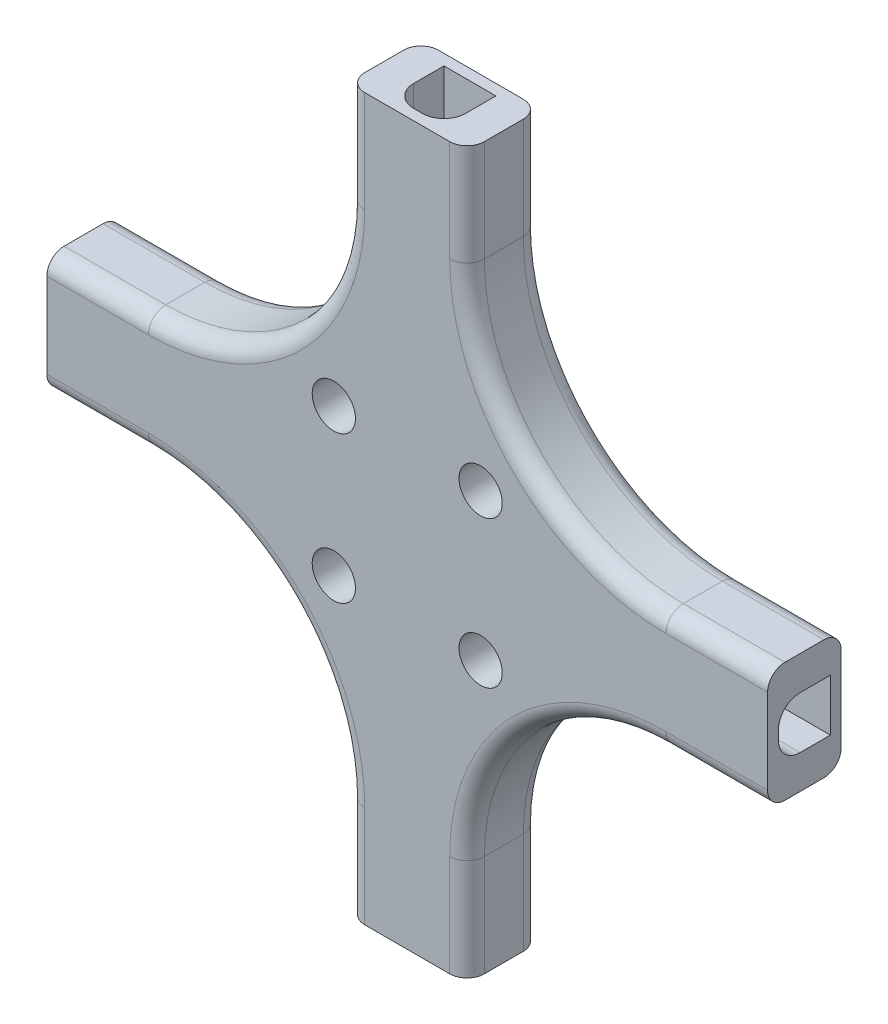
ISO-10303-21;
HEADER;
FILE_DESCRIPTION(('STEP AP214'),'2;1');
FILE_NAME('part.step','',(''),(''),'','','');
FILE_SCHEMA(('AUTOMOTIVE_DESIGN { 1 0 10303 214 1 1 1 1 }'));
ENDSEC;
DATA;
#1=APPLICATION_CONTEXT('core data for automotive mechanical design processes');
#2=APPLICATION_PROTOCOL_DEFINITION('international standard','automotive_design',2000,#1);
#3=PRODUCT_CONTEXT('',#1,'mechanical');
#4=PRODUCT('Part','Part','',(#3));
#5=PRODUCT_RELATED_PRODUCT_CATEGORY('part','',(#4));
#6=PRODUCT_DEFINITION_FORMATION('','',#4);
#7=PRODUCT_DEFINITION_CONTEXT('part definition',#1,'design');
#8=PRODUCT_DEFINITION('design','',#6,#7);
#9=PRODUCT_DEFINITION_SHAPE('','',#8);
#10=(LENGTH_UNIT() NAMED_UNIT(*) SI_UNIT(.MILLI.,.METRE.));
#11=(NAMED_UNIT(*) PLANE_ANGLE_UNIT() SI_UNIT($,.RADIAN.));
#12=(NAMED_UNIT(*) SI_UNIT($,.STERADIAN.) SOLID_ANGLE_UNIT());
#13=UNCERTAINTY_MEASURE_WITH_UNIT(LENGTH_MEASURE(1.E-05),#10,'distance_accuracy_value','');
#14=(GEOMETRIC_REPRESENTATION_CONTEXT(3) GLOBAL_UNCERTAINTY_ASSIGNED_CONTEXT((#13)) GLOBAL_UNIT_ASSIGNED_CONTEXT((#10,
#11,#12)) REPRESENTATION_CONTEXT('',''));
#15=CARTESIAN_POINT('',(0.,0.,0.));
#16=DIRECTION('',(0.,0.,1.));
#17=DIRECTION('',(1.,0.,0.));
#18=AXIS2_PLACEMENT_3D('',#15,#16,#17);
#19=CARTESIAN_POINT('',(0.497656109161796,14.65,-1.24541417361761));
#20=DIRECTION('',(-0.000781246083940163,0.,0.999999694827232));
#21=DIRECTION('',(0.999999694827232,0.,0.000781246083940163));
#22=AXIS2_PLACEMENT_3D('',#19,#20,#21);
#23=PLANE('',#22);
#24=DIRECTION('',(0.,-1.,0.));
#25=VECTOR('',#24,1.);
#26=CARTESIAN_POINT('',(0.497656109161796,14.65,-1.24541417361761));
#27=LINE('',#26,#25);
#28=CARTESIAN_POINT('',(0.497656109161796,41.65,-1.24541417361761));
#29=VERTEX_POINT('',#28);
#30=CARTESIAN_POINT('',(0.497656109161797,14.65,-1.24541417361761));
#31=VERTEX_POINT('',#30);
#32=EDGE_CURVE('E860',#29,#31,#27,.T.);
#33=ORIENTED_EDGE('',*,*,#32,.T.);
#34=DIRECTION('',(0.999999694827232,0.,0.000781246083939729));
#35=VECTOR('',#34,1.);
#36=CARTESIAN_POINT('',(-0.502343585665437,14.65,-1.24619541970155));
#37=LINE('',#36,#35);
#38=CARTESIAN_POINT('',(-0.502343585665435,14.65,-1.24619541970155));
#39=VERTEX_POINT('',#38);
#40=EDGE_CURVE('E1041',#39,#31,#37,.T.);
#41=ORIENTED_EDGE('',*,*,#40,.F.);
#42=DIRECTION('',(0.,-1.,0.));
#43=VECTOR('',#42,1.);
#44=CARTESIAN_POINT('',(-0.502343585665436,14.65,-1.24619541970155));
#45=LINE('',#44,#43);
#46=CARTESIAN_POINT('',(-0.502343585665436,41.65,-1.24619541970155));
#47=VERTEX_POINT('',#46);
#48=EDGE_CURVE('E863',#39,#47,#45,.F.);
#49=ORIENTED_EDGE('',*,*,#48,.T.);
#50=DIRECTION('',(0.999999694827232,0.,0.000781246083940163));
#51=VECTOR('',#50,1.);
#52=CARTESIAN_POINT('',(0.497656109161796,41.65,-1.24541417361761));
#53=LINE('',#52,#51);
#54=EDGE_CURVE('E1067',#29,#47,#53,.F.);
#55=ORIENTED_EDGE('',*,*,#54,.F.);
#56=EDGE_LOOP('',(#33,#41,#49,#55));
#57=FACE_BOUND('',#56,.T.);
#58=ADVANCED_FACE('F16',(#57),#23,.F.);
#59=CARTESIAN_POINT('',(0.499609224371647,14.65,-3.74541341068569));
#60=DIRECTION('',(0.,1.,0.));
#61=DIRECTION('',(0.,0.,1.));
#62=AXIS2_PLACEMENT_3D('',#59,#60,#61);
#63=PLANE('',#62);
#64=DIRECTION('',(-0.000781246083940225,0.,0.999999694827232));
#65=VECTOR('',#64,1.);
#66=CARTESIAN_POINT('',(-3.00038970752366,14.65,-3.74814777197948));
#67=LINE('',#66,#65);
#68=CARTESIAN_POINT('',(-2.99765534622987,14.65,-7.24814670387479));
#69=VERTEX_POINT('',#68);
#70=CARTESIAN_POINT('',(-3.00038970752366,14.65,-3.74814777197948));
#71=VERTEX_POINT('',#70);
#72=EDGE_CURVE('E321',#69,#71,#67,.T.);
#73=ORIENTED_EDGE('',*,*,#72,.T.);
#74=CARTESIAN_POINT('',(-0.500390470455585,14.65,-3.74619465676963));
#75=DIRECTION('',(0.,-1.,0.));
#76=DIRECTION('',(0.,0.,-1.));
#77=AXIS2_PLACEMENT_3D('',#74,#75,#76);
#78=CIRCLE('',#77,2.5);
#79=EDGE_CURVE('E19',#71,#39,#78,.F.);
#80=ORIENTED_EDGE('',*,*,#79,.T.);
#81=ORIENTED_EDGE('',*,*,#40,.T.);
#82=CARTESIAN_POINT('',(0.499609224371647,14.65,-3.74541341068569));
#83=DIRECTION('',(0.,-1.,0.));
#84=DIRECTION('',(0.,0.,-1.));
#85=AXIS2_PLACEMENT_3D('',#82,#83,#84);
#86=CIRCLE('',#85,2.5);
#87=CARTESIAN_POINT('',(2.99960846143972,14.65,-3.74346029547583));
#88=VERTEX_POINT('',#87);
#89=EDGE_CURVE('E859',#31,#88,#86,.F.);
#90=ORIENTED_EDGE('',*,*,#89,.T.);
#91=DIRECTION('',(0.000781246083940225,0.,-0.999999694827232));
#92=VECTOR('',#91,1.);
#93=CARTESIAN_POINT('',(3.00234282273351,14.65,-7.24345922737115));
#94=LINE('',#93,#92);
#95=CARTESIAN_POINT('',(3.00234282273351,14.65,-7.24345922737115));
#96=VERTEX_POINT('',#95);
#97=EDGE_CURVE('E886',#88,#96,#94,.T.);
#98=ORIENTED_EDGE('',*,*,#97,.T.);
#99=DIRECTION('',(-0.999999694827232,0.,-0.000781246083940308));
#100=VECTOR('',#99,1.);
#101=CARTESIAN_POINT('',(-2.99765534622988,14.65,-7.24814670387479));
#102=LINE('',#101,#100);
#103=EDGE_CURVE('E329',#96,#69,#102,.T.);
#104=ORIENTED_EDGE('',*,*,#103,.T.);
#105=EDGE_LOOP('',(#73,#80,#81,#90,#98,#104));
#106=FACE_BOUND('',#105,.T.);
#107=ADVANCED_FACE('F1203',(#106),#63,.T.);
#108=CARTESIAN_POINT('',(-14.65,-0.503977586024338,-3.75));
#109=DIRECTION('',(1.,0.,0.));
#110=DIRECTION('',(0.,1.,0.));
#111=AXIS2_PLACEMENT_3D('',#108,#109,#110);
#112=PLANE('',#111);
#113=CARTESIAN_POINT('',(-14.65,0.496022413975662,-3.75));
#114=DIRECTION('',(1.,0.,0.));
#115=DIRECTION('',(0.,1.,0.));
#116=AXIS2_PLACEMENT_3D('',#113,#114,#115);
#117=CIRCLE('',#116,2.5);
#118=CARTESIAN_POINT('',(-14.65,0.496022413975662,-1.25));
#119=VERTEX_POINT('',#118);
#120=CARTESIAN_POINT('',(-14.65,2.99602241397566,-3.75));
#121=VERTEX_POINT('',#120);
#122=EDGE_CURVE('E793',#119,#121,#117,.F.);
#123=ORIENTED_EDGE('',*,*,#122,.T.);
#124=DIRECTION('',(0.,0.,1.));
#125=VECTOR('',#124,1.);
#126=CARTESIAN_POINT('',(-14.65,2.99602241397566,-3.75));
#127=LINE('',#126,#125);
#128=CARTESIAN_POINT('',(-14.65,2.99602241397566,-7.25));
#129=VERTEX_POINT('',#128);
#130=EDGE_CURVE('E788',#129,#121,#127,.T.);
#131=ORIENTED_EDGE('',*,*,#130,.F.);
#132=DIRECTION('',(0.,-1.,0.));
#133=VECTOR('',#132,1.);
#134=CARTESIAN_POINT('',(-14.65,2.99602241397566,-7.25));
#135=LINE('',#134,#133);
#136=CARTESIAN_POINT('',(-14.65,-3.00397758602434,-7.25));
#137=VERTEX_POINT('',#136);
#138=EDGE_CURVE('E781',#137,#129,#135,.F.);
#139=ORIENTED_EDGE('',*,*,#138,.F.);
#140=DIRECTION('',(0.,0.,1.));
#141=VECTOR('',#140,1.);
#142=CARTESIAN_POINT('',(-14.65,-3.00397758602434,-7.25));
#143=LINE('',#142,#141);
#144=CARTESIAN_POINT('',(-14.65,-3.00397758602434,-3.75));
#145=VERTEX_POINT('',#144);
#146=EDGE_CURVE('E767',#145,#137,#143,.F.);
#147=ORIENTED_EDGE('',*,*,#146,.F.);
#148=CARTESIAN_POINT('',(-14.65,-0.503977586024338,-3.75));
#149=DIRECTION('',(1.,0.,0.));
#150=DIRECTION('',(0.,1.,0.));
#151=AXIS2_PLACEMENT_3D('',#148,#149,#150);
#152=CIRCLE('',#151,2.5);
#153=CARTESIAN_POINT('',(-14.65,-0.503977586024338,-1.25));
#154=VERTEX_POINT('',#153);
#155=EDGE_CURVE('E758',#145,#154,#152,.F.);
#156=ORIENTED_EDGE('',*,*,#155,.T.);
#157=DIRECTION('',(0.,1.,0.));
#158=VECTOR('',#157,1.);
#159=CARTESIAN_POINT('',(-14.65,-0.503977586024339,-1.25));
#160=LINE('',#159,#158);
#161=EDGE_CURVE('E1016',#119,#154,#160,.F.);
#162=ORIENTED_EDGE('',*,*,#161,.F.);
#163=EDGE_LOOP('',(#123,#131,#139,#147,#156,#162));
#164=FACE_BOUND('',#163,.T.);
#165=ADVANCED_FACE('F1500',(#164),#112,.F.);
#166=CARTESIAN_POINT('',(-14.65,-0.503977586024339,-1.25));
#167=DIRECTION('',(0.,0.,-1.));
#168=DIRECTION('',(-1.,0.,0.));
#169=AXIS2_PLACEMENT_3D('',#166,#167,#168);
#170=PLANE('',#169);
#171=ORIENTED_EDGE('',*,*,#161,.T.);
#172=DIRECTION('',(1.,0.,0.));
#173=VECTOR('',#172,1.);
#174=CARTESIAN_POINT('',(-14.65,-0.503977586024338,-1.25));
#175=LINE('',#174,#173);
#176=CARTESIAN_POINT('',(-41.65,-0.503977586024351,-1.25));
#177=VERTEX_POINT('',#176);
#178=EDGE_CURVE('E753',#154,#177,#175,.F.);
#179=ORIENTED_EDGE('',*,*,#178,.T.);
#180=DIRECTION('',(0.,1.,0.));
#181=VECTOR('',#180,1.);
#182=CARTESIAN_POINT('',(-41.65,-0.503977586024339,-1.25));
#183=LINE('',#182,#181);
#184=CARTESIAN_POINT('',(-41.65,0.496022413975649,-1.25));
#185=VERTEX_POINT('',#184);
#186=EDGE_CURVE('E1038',#177,#185,#183,.T.);
#187=ORIENTED_EDGE('',*,*,#186,.T.);
#188=DIRECTION('',(1.,0.,0.));
#189=VECTOR('',#188,1.);
#190=CARTESIAN_POINT('',(-14.65,0.496022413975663,-1.25));
#191=LINE('',#190,#189);
#192=EDGE_CURVE('E789',#185,#119,#191,.T.);
#193=ORIENTED_EDGE('',*,*,#192,.T.);
#194=EDGE_LOOP('',(#171,#179,#187,#193));
#195=FACE_BOUND('',#194,.T.);
#196=ADVANCED_FACE('F2162',(#195),#170,.T.);
#197=CARTESIAN_POINT('',(0.499609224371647,-14.65,-3.74541341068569));
#198=DIRECTION('',(0.,1.,0.));
#199=DIRECTION('',(0.,0.,1.));
#200=AXIS2_PLACEMENT_3D('',#197,#198,#199);
#201=PLANE('',#200);
#202=CARTESIAN_POINT('',(-0.500390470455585,-14.65,-3.74619465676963));
#203=DIRECTION('',(0.,1.,0.));
#204=DIRECTION('',(0.,0.,1.));
#205=AXIS2_PLACEMENT_3D('',#202,#203,#204);
#206=CIRCLE('',#205,2.5);
#207=CARTESIAN_POINT('',(-0.502343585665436,-14.65,-1.24619541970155));
#208=VERTEX_POINT('',#207);
#209=CARTESIAN_POINT('',(-3.00038970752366,-14.65,-3.74814777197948));
#210=VERTEX_POINT('',#209);
#211=EDGE_CURVE('E707',#208,#210,#206,.F.);
#212=ORIENTED_EDGE('',*,*,#211,.T.);
#213=DIRECTION('',(0.000781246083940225,0.,-0.999999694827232));
#214=VECTOR('',#213,1.);
#215=CARTESIAN_POINT('',(-3.00038970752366,-14.65,-3.74814777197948));
#216=LINE('',#215,#214);
#217=CARTESIAN_POINT('',(-2.99765534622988,-14.65,-7.24814670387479));
#218=VERTEX_POINT('',#217);
#219=EDGE_CURVE('E702',#218,#210,#216,.F.);
#220=ORIENTED_EDGE('',*,*,#219,.F.);
#221=DIRECTION('',(0.999999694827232,0.,0.000781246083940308));
#222=VECTOR('',#221,1.);
#223=CARTESIAN_POINT('',(-2.99765534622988,-14.65,-7.24814670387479));
#224=LINE('',#223,#222);
#225=CARTESIAN_POINT('',(3.00234282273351,-14.65,-7.24345922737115));
#226=VERTEX_POINT('',#225);
#227=EDGE_CURVE('E695',#226,#218,#224,.F.);
#228=ORIENTED_EDGE('',*,*,#227,.F.);
#229=DIRECTION('',(-0.000781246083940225,0.,0.999999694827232));
#230=VECTOR('',#229,1.);
#231=CARTESIAN_POINT('',(3.00234282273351,-14.65,-7.24345922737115));
#232=LINE('',#231,#230);
#233=CARTESIAN_POINT('',(2.99960846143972,-14.65,-3.74346029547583));
#234=VERTEX_POINT('',#233);
#235=EDGE_CURVE('E681',#234,#226,#232,.F.);
#236=ORIENTED_EDGE('',*,*,#235,.F.);
#237=CARTESIAN_POINT('',(0.499609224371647,-14.65,-3.74541341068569));
#238=DIRECTION('',(0.,1.,0.));
#239=DIRECTION('',(0.,0.,1.));
#240=AXIS2_PLACEMENT_3D('',#237,#238,#239);
#241=CIRCLE('',#240,2.5);
#242=CARTESIAN_POINT('',(0.497656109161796,-14.65,-1.24541417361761));
#243=VERTEX_POINT('',#242);
#244=EDGE_CURVE('E672',#234,#243,#241,.F.);
#245=ORIENTED_EDGE('',*,*,#244,.T.);
#246=DIRECTION('',(-0.999999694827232,0.,-0.000781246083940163));
#247=VECTOR('',#246,1.);
#248=CARTESIAN_POINT('',(0.497656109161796,-14.65,-1.24541417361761));
#249=LINE('',#248,#247);
#250=EDGE_CURVE('E1003',#208,#243,#249,.F.);
#251=ORIENTED_EDGE('',*,*,#250,.F.);
#252=EDGE_LOOP('',(#212,#220,#228,#236,#245,#251));
#253=FACE_BOUND('',#252,.T.);
#254=ADVANCED_FACE('F2153',(#253),#201,.F.);
#255=CARTESIAN_POINT('',(0.497656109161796,-14.65,-1.24541417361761));
#256=DIRECTION('',(0.000781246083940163,0.,-0.999999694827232));
#257=DIRECTION('',(-0.999999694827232,0.,-0.000781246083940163));
#258=AXIS2_PLACEMENT_3D('',#255,#256,#257);
#259=PLANE('',#258);
#260=ORIENTED_EDGE('',*,*,#250,.T.);
#261=DIRECTION('',(0.,1.,0.));
#262=VECTOR('',#261,1.);
#263=CARTESIAN_POINT('',(0.497656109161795,-14.65,-1.24541417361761));
#264=LINE('',#263,#262);
#265=CARTESIAN_POINT('',(0.497656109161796,-41.65,-1.24541417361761));
#266=VERTEX_POINT('',#265);
#267=EDGE_CURVE('E667',#243,#266,#264,.F.);
#268=ORIENTED_EDGE('',*,*,#267,.T.);
#269=DIRECTION('',(-0.999999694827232,0.,-0.000781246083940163));
#270=VECTOR('',#269,1.);
#271=CARTESIAN_POINT('',(0.497656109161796,-41.65,-1.24541417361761));
#272=LINE('',#271,#270);
#273=CARTESIAN_POINT('',(-0.502343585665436,-41.65,-1.24619541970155));
#274=VERTEX_POINT('',#273);
#275=EDGE_CURVE('E1013',#266,#274,#272,.T.);
#276=ORIENTED_EDGE('',*,*,#275,.T.);
#277=DIRECTION('',(0.,1.,0.));
#278=VECTOR('',#277,1.);
#279=CARTESIAN_POINT('',(-0.502343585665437,-14.65,-1.24619541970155));
#280=LINE('',#279,#278);
#281=EDGE_CURVE('E703',#274,#208,#280,.T.);
#282=ORIENTED_EDGE('',*,*,#281,.T.);
#283=EDGE_LOOP('',(#260,#268,#276,#282));
#284=FACE_BOUND('',#283,.T.);
#285=ADVANCED_FACE('F2145',(#284),#259,.T.);
#286=CARTESIAN_POINT('',(14.65,-0.503977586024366,-1.25));
#287=DIRECTION('',(0.,0.,1.));
#288=DIRECTION('',(1.,0.,0.));
#289=AXIS2_PLACEMENT_3D('',#286,#287,#288);
#290=PLANE('',#289);
#291=DIRECTION('',(-1.,0.,0.));
#292=VECTOR('',#291,1.);
#293=CARTESIAN_POINT('',(14.65,-0.503977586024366,-1.25));
#294=LINE('',#293,#292);
#295=CARTESIAN_POINT('',(41.65,-0.503977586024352,-1.25));
#296=VERTEX_POINT('',#295);
#297=CARTESIAN_POINT('',(14.65,-0.503977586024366,-1.25));
#298=VERTEX_POINT('',#297);
#299=EDGE_CURVE('E607',#296,#298,#294,.T.);
#300=ORIENTED_EDGE('',*,*,#299,.T.);
#301=DIRECTION('',(0.,1.,0.));
#302=VECTOR('',#301,1.);
#303=CARTESIAN_POINT('',(14.65,-0.503977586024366,-1.25));
#304=LINE('',#303,#302);
#305=CARTESIAN_POINT('',(14.65,0.496022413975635,-1.25));
#306=VERTEX_POINT('',#305);
#307=EDGE_CURVE('E985',#306,#298,#304,.F.);
#308=ORIENTED_EDGE('',*,*,#307,.F.);
#309=DIRECTION('',(-1.,0.,0.));
#310=VECTOR('',#309,1.);
#311=CARTESIAN_POINT('',(14.65,0.496022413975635,-1.25));
#312=LINE('',#311,#310);
#313=CARTESIAN_POINT('',(41.65,0.496022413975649,-1.25));
#314=VERTEX_POINT('',#313);
#315=EDGE_CURVE('E610',#306,#314,#312,.F.);
#316=ORIENTED_EDGE('',*,*,#315,.T.);
#317=DIRECTION('',(0.,1.,0.));
#318=VECTOR('',#317,1.);
#319=CARTESIAN_POINT('',(41.65,-0.503977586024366,-1.25));
#320=LINE('',#319,#318);
#321=EDGE_CURVE('E1000',#296,#314,#320,.T.);
#322=ORIENTED_EDGE('',*,*,#321,.F.);
#323=EDGE_LOOP('',(#300,#308,#316,#322));
#324=FACE_BOUND('',#323,.T.);
#325=ADVANCED_FACE('F1595',(#324),#290,.F.);
#326=CARTESIAN_POINT('',(14.65,-0.503977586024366,-3.75));
#327=DIRECTION('',(1.,0.,0.));
#328=DIRECTION('',(0.,1.,0.));
#329=AXIS2_PLACEMENT_3D('',#326,#327,#328);
#330=PLANE('',#329);
#331=DIRECTION('',(0.,0.,1.));
#332=VECTOR('',#331,1.);
#333=CARTESIAN_POINT('',(14.65,2.99602241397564,-3.75));
#334=LINE('',#333,#332);
#335=CARTESIAN_POINT('',(14.65,2.99602241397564,-7.25));
#336=VERTEX_POINT('',#335);
#337=CARTESIAN_POINT('',(14.65,2.99602241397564,-3.75));
#338=VERTEX_POINT('',#337);
#339=EDGE_CURVE('E619',#336,#338,#334,.T.);
#340=ORIENTED_EDGE('',*,*,#339,.T.);
#341=CARTESIAN_POINT('',(14.65,0.496022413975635,-3.75));
#342=DIRECTION('',(-1.,0.,0.));
#343=DIRECTION('',(0.,-1.,0.));
#344=AXIS2_PLACEMENT_3D('',#341,#342,#343);
#345=CIRCLE('',#344,2.5);
#346=EDGE_CURVE('E614',#338,#306,#345,.F.);
#347=ORIENTED_EDGE('',*,*,#346,.T.);
#348=ORIENTED_EDGE('',*,*,#307,.T.);
#349=CARTESIAN_POINT('',(14.65,-0.503977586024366,-3.75));
#350=DIRECTION('',(-1.,0.,0.));
#351=DIRECTION('',(0.,-1.,0.));
#352=AXIS2_PLACEMENT_3D('',#349,#350,#351);
#353=CIRCLE('',#352,2.5);
#354=CARTESIAN_POINT('',(14.65,-3.00397758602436,-3.75));
#355=VERTEX_POINT('',#354);
#356=EDGE_CURVE('E606',#298,#355,#353,.F.);
#357=ORIENTED_EDGE('',*,*,#356,.T.);
#358=DIRECTION('',(0.,0.,1.));
#359=VECTOR('',#358,1.);
#360=CARTESIAN_POINT('',(14.65,-3.00397758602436,-7.25));
#361=LINE('',#360,#359);
#362=CARTESIAN_POINT('',(14.65,-3.00397758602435,-7.25));
#363=VERTEX_POINT('',#362);
#364=EDGE_CURVE('E638',#355,#363,#361,.F.);
#365=ORIENTED_EDGE('',*,*,#364,.T.);
#366=DIRECTION('',(0.,1.,0.));
#367=VECTOR('',#366,1.);
#368=CARTESIAN_POINT('',(14.65,2.99602241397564,-7.25));
#369=LINE('',#368,#367);
#370=EDGE_CURVE('E624',#363,#336,#369,.T.);
#371=ORIENTED_EDGE('',*,*,#370,.T.);
#372=EDGE_LOOP('',(#340,#347,#348,#357,#365,#371));
#373=FACE_BOUND('',#372,.T.);
#374=ADVANCED_FACE('F1572',(#373),#330,.T.);
#375=CARTESIAN_POINT('',(29.91,-29.91,-6.5));
#376=DIRECTION('',(0.,0.,1.));
#377=DIRECTION('',(1.,0.,0.));
#378=AXIS2_PLACEMENT_3D('',#375,#376,#377);
#379=TOROIDAL_SURFACE('',#378,25.,2.);
#380=CARTESIAN_POINT('',(29.91,-29.91,-6.5));
#381=DIRECTION('',(0.,0.,-1.));
#382=DIRECTION('',(-1.,0.,0.));
#383=AXIS2_PLACEMENT_3D('',#380,#381,#382);
#384=CIRCLE('',#383,23.);
#385=CARTESIAN_POINT('',(29.91,-6.91,-6.5));
#386=VERTEX_POINT('',#385);
#387=CARTESIAN_POINT('',(6.91,-29.91,-6.5));
#388=VERTEX_POINT('',#387);
#389=EDGE_CURVE('E664',#386,#388,#384,.F.);
#390=ORIENTED_EDGE('',*,*,#389,.T.);
#391=CARTESIAN_POINT('',(4.91,-29.91,-6.5));
#392=DIRECTION('',(0.,1.,0.));
#393=DIRECTION('',(-1.,0.,0.));
#394=AXIS2_PLACEMENT_3D('',#391,#392,#393);
#395=CIRCLE('',#394,2.);
#396=CARTESIAN_POINT('',(4.91,-29.91,-8.5));
#397=VERTEX_POINT('',#396);
#398=EDGE_CURVE('E749',#397,#388,#395,.F.);
#399=ORIENTED_EDGE('',*,*,#398,.F.);
#400=CARTESIAN_POINT('',(29.91,-29.91,-8.5));
#401=DIRECTION('',(0.,0.,-1.));
#402=DIRECTION('',(-1.,0.,0.));
#403=AXIS2_PLACEMENT_3D('',#400,#401,#402);
#404=CIRCLE('',#403,25.);
#405=CARTESIAN_POINT('',(29.91,-4.91,-8.5));
#406=VERTEX_POINT('',#405);
#407=EDGE_CURVE('E542',#397,#406,#404,.T.);
#408=ORIENTED_EDGE('',*,*,#407,.T.);
#409=CARTESIAN_POINT('',(29.91,-4.91,-6.5));
#410=DIRECTION('',(1.,0.,0.));
#411=DIRECTION('',(0.,0.,-1.));
#412=AXIS2_PLACEMENT_3D('',#409,#410,#411);
#413=CIRCLE('',#412,2.);
#414=EDGE_CURVE('E361',#386,#406,#413,.T.);
#415=ORIENTED_EDGE('',*,*,#414,.F.);
#416=EDGE_LOOP('',(#390,#399,#408,#415));
#417=FACE_BOUND('',#416,.T.);
#418=ADVANCED_FACE('F946',(#417),#379,.T.);
#419=CARTESIAN_POINT('',(29.91,29.91,-6.5));
#420=DIRECTION('',(0.,0.,1.));
#421=DIRECTION('',(1.,0.,0.));
#422=AXIS2_PLACEMENT_3D('',#419,#420,#421);
#423=TOROIDAL_SURFACE('',#422,25.,2.);
#424=CARTESIAN_POINT('',(29.91,29.91,-6.5));
#425=DIRECTION('',(0.,0.,-1.));
#426=DIRECTION('',(-1.,0.,0.));
#427=AXIS2_PLACEMENT_3D('',#424,#425,#426);
#428=CIRCLE('',#427,23.);
#429=CARTESIAN_POINT('',(6.91,29.91,-6.5));
#430=VERTEX_POINT('',#429);
#431=CARTESIAN_POINT('',(29.91,6.91,-6.5));
#432=VERTEX_POINT('',#431);
#433=EDGE_CURVE('E348',#430,#432,#428,.F.);
#434=ORIENTED_EDGE('',*,*,#433,.T.);
#435=CARTESIAN_POINT('',(29.91,4.91,-6.5));
#436=DIRECTION('',(-1.,0.,0.));
#437=DIRECTION('',(0.,0.,1.));
#438=AXIS2_PLACEMENT_3D('',#435,#436,#437);
#439=CIRCLE('',#438,2.);
#440=CARTESIAN_POINT('',(29.91,4.91,-8.5));
#441=VERTEX_POINT('',#440);
#442=EDGE_CURVE('E605',#441,#432,#439,.F.);
#443=ORIENTED_EDGE('',*,*,#442,.F.);
#444=CARTESIAN_POINT('',(29.91,29.91,-8.5));
#445=DIRECTION('',(0.,0.,-1.));
#446=DIRECTION('',(0.,-1.,0.));
#447=AXIS2_PLACEMENT_3D('',#444,#445,#446);
#448=CIRCLE('',#447,25.);
#449=CARTESIAN_POINT('',(4.91,29.91,-8.5));
#450=VERTEX_POINT('',#449);
#451=EDGE_CURVE('E521',#441,#450,#448,.T.);
#452=ORIENTED_EDGE('',*,*,#451,.T.);
#453=CARTESIAN_POINT('',(4.91,29.91,-6.5));
#454=DIRECTION('',(0.,1.,0.));
#455=DIRECTION('',(-1.,0.,0.));
#456=AXIS2_PLACEMENT_3D('',#453,#454,#455);
#457=CIRCLE('',#456,2.);
#458=EDGE_CURVE('E452',#430,#450,#457,.T.);
#459=ORIENTED_EDGE('',*,*,#458,.F.);
#460=EDGE_LOOP('',(#434,#443,#452,#459));
#461=FACE_BOUND('',#460,.T.);
#462=ADVANCED_FACE('F942',(#461),#423,.T.);
#463=CARTESIAN_POINT('',(-29.91,29.91,-6.5));
#464=DIRECTION('',(0.,0.,1.));
#465=DIRECTION('',(1.,0.,0.));
#466=AXIS2_PLACEMENT_3D('',#463,#464,#465);
#467=TOROIDAL_SURFACE('',#466,25.,2.);
#468=CARTESIAN_POINT('',(-29.91,29.91,-6.5));
#469=DIRECTION('',(0.,0.,-1.));
#470=DIRECTION('',(-1.,0.,0.));
#471=AXIS2_PLACEMENT_3D('',#468,#469,#470);
#472=CIRCLE('',#471,23.);
#473=CARTESIAN_POINT('',(-29.91,6.91,-6.5));
#474=VERTEX_POINT('',#473);
#475=CARTESIAN_POINT('',(-6.91,29.91,-6.5));
#476=VERTEX_POINT('',#475);
#477=EDGE_CURVE('E448',#474,#476,#472,.F.);
#478=ORIENTED_EDGE('',*,*,#477,.T.);
#479=CARTESIAN_POINT('',(-4.91,29.91,-6.5));
#480=DIRECTION('',(0.,-1.,0.));
#481=DIRECTION('',(1.,0.,0.));
#482=AXIS2_PLACEMENT_3D('',#479,#480,#481);
#483=CIRCLE('',#482,2.);
#484=CARTESIAN_POINT('',(-4.91,29.91,-8.5));
#485=VERTEX_POINT('',#484);
#486=EDGE_CURVE('E440',#485,#476,#483,.F.);
#487=ORIENTED_EDGE('',*,*,#486,.F.);
#488=CARTESIAN_POINT('',(-29.91,29.91,-8.5));
#489=DIRECTION('',(0.,0.,-1.));
#490=DIRECTION('',(1.,0.,0.));
#491=AXIS2_PLACEMENT_3D('',#488,#489,#490);
#492=CIRCLE('',#491,25.);
#493=CARTESIAN_POINT('',(-29.91,4.91,-8.5));
#494=VERTEX_POINT('',#493);
#495=EDGE_CURVE('E444',#485,#494,#492,.T.);
#496=ORIENTED_EDGE('',*,*,#495,.T.);
#497=CARTESIAN_POINT('',(-29.91,4.90999999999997,-6.5));
#498=DIRECTION('',(-1.,0.,0.));
#499=DIRECTION('',(0.,-1.,0.));
#500=AXIS2_PLACEMENT_3D('',#497,#498,#499);
#501=CIRCLE('',#500,2.);
#502=EDGE_CURVE('E811',#474,#494,#501,.T.);
#503=ORIENTED_EDGE('',*,*,#502,.F.);
#504=EDGE_LOOP('',(#478,#487,#496,#503));
#505=FACE_BOUND('',#504,.T.);
#506=ADVANCED_FACE('F442',(#505),#467,.T.);
#507=CARTESIAN_POINT('',(-29.91,-29.91,-6.5));
#508=DIRECTION('',(0.,0.,1.));
#509=DIRECTION('',(1.,0.,0.));
#510=AXIS2_PLACEMENT_3D('',#507,#508,#509);
#511=TOROIDAL_SURFACE('',#510,25.,2.);
#512=CARTESIAN_POINT('',(-29.91,-4.91,-6.5));
#513=DIRECTION('',(1.,0.,0.));
#514=DIRECTION('',(0.,0.,-1.));
#515=AXIS2_PLACEMENT_3D('',#512,#513,#514);
#516=CIRCLE('',#515,2.);
#517=CARTESIAN_POINT('',(-29.91,-4.91,-8.5));
#518=VERTEX_POINT('',#517);
#519=CARTESIAN_POINT('',(-29.91,-6.91,-6.5));
#520=VERTEX_POINT('',#519);
#521=EDGE_CURVE('E828',#518,#520,#516,.F.);
#522=ORIENTED_EDGE('',*,*,#521,.F.);
#523=CARTESIAN_POINT('',(-29.91,-29.91,-8.5));
#524=DIRECTION('',(0.,0.,-1.));
#525=DIRECTION('',(0.,1.,0.));
#526=AXIS2_PLACEMENT_3D('',#523,#524,#525);
#527=CIRCLE('',#526,25.);
#528=CARTESIAN_POINT('',(-4.91,-29.91,-8.5));
#529=VERTEX_POINT('',#528);
#530=EDGE_CURVE('E568',#518,#529,#527,.T.);
#531=ORIENTED_EDGE('',*,*,#530,.T.);
#532=CARTESIAN_POINT('',(-4.91,-29.91,-6.5));
#533=DIRECTION('',(0.,-1.,0.));
#534=DIRECTION('',(1.,0.,0.));
#535=AXIS2_PLACEMENT_3D('',#532,#533,#534);
#536=CIRCLE('',#535,2.);
#537=CARTESIAN_POINT('',(-6.91,-29.91,-6.5));
#538=VERTEX_POINT('',#537);
#539=EDGE_CURVE('E725',#538,#529,#536,.T.);
#540=ORIENTED_EDGE('',*,*,#539,.F.);
#541=CARTESIAN_POINT('',(-29.91,-29.91,-6.5));
#542=DIRECTION('',(0.,0.,-1.));
#543=DIRECTION('',(-1.,0.,0.));
#544=AXIS2_PLACEMENT_3D('',#541,#542,#543);
#545=CIRCLE('',#544,23.);
#546=EDGE_CURVE('E750',#538,#520,#545,.F.);
#547=ORIENTED_EDGE('',*,*,#546,.T.);
#548=EDGE_LOOP('',(#522,#531,#540,#547));
#549=FACE_BOUND('',#548,.T.);
#550=ADVANCED_FACE('F898',(#549),#511,.T.);
#551=CARTESIAN_POINT('',(29.91,29.91,-8.5));
#552=DIRECTION('',(0.,0.,-1.));
#553=DIRECTION('',(-1.,0.,0.));
#554=AXIS2_PLACEMENT_3D('',#551,#552,#553);
#555=CYLINDRICAL_SURFACE('',#554,23.);
#556=CARTESIAN_POINT('',(29.91,29.91,-2.));
#557=DIRECTION('',(0.,0.,1.));
#558=DIRECTION('',(1.,0.,0.));
#559=AXIS2_PLACEMENT_3D('',#556,#557,#558);
#560=CIRCLE('',#559,23.);
#561=CARTESIAN_POINT('',(29.91,6.91,-2.));
#562=VERTEX_POINT('',#561);
#563=CARTESIAN_POINT('',(6.91,29.91,-2.));
#564=VERTEX_POINT('',#563);
#565=EDGE_CURVE('E563',#562,#564,#560,.F.);
#566=ORIENTED_EDGE('',*,*,#565,.F.);
#567=DIRECTION('',(0.,0.,-1.));
#568=VECTOR('',#567,1.);
#569=CARTESIAN_POINT('',(29.91,6.91,-8.5));
#570=LINE('',#569,#568);
#571=EDGE_CURVE('E560',#562,#432,#570,.T.);
#572=ORIENTED_EDGE('',*,*,#571,.T.);
#573=ORIENTED_EDGE('',*,*,#433,.F.);
#574=DIRECTION('',(0.,0.,1.));
#575=VECTOR('',#574,1.);
#576=CARTESIAN_POINT('',(6.91,29.91,-8.5));
#577=LINE('',#576,#575);
#578=EDGE_CURVE('E849',#430,#564,#577,.T.);
#579=ORIENTED_EDGE('',*,*,#578,.T.);
#580=EDGE_LOOP('',(#566,#572,#573,#579));
#581=FACE_BOUND('',#580,.T.);
#582=ADVANCED_FACE('F903',(#581),#555,.F.);
#583=CARTESIAN_POINT('',(3.00234282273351,14.65,-7.24345922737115));
#584=DIRECTION('',(0.999999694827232,0.,0.000781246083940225));
#585=DIRECTION('',(0.000781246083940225,0.,-0.999999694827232));
#586=AXIS2_PLACEMENT_3D('',#583,#584,#585);
#587=PLANE('',#586);
#588=DIRECTION('',(0.,1.,0.));
#589=VECTOR('',#588,1.);
#590=CARTESIAN_POINT('',(3.00234282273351,14.65,-7.24345922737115));
#591=LINE('',#590,#589);
#592=CARTESIAN_POINT('',(3.00234282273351,41.65,-7.24345922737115));
#593=VERTEX_POINT('',#592);
#594=EDGE_CURVE('E882',#593,#96,#591,.F.);
#595=ORIENTED_EDGE('',*,*,#594,.T.);
#596=ORIENTED_EDGE('',*,*,#97,.F.);
#597=DIRECTION('',(0.,-1.,0.));
#598=VECTOR('',#597,1.);
#599=CARTESIAN_POINT('',(2.99960846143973,14.65,-3.74346029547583));
#600=LINE('',#599,#598);
#601=CARTESIAN_POINT('',(2.99960846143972,41.65,-3.74346029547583));
#602=VERTEX_POINT('',#601);
#603=EDGE_CURVE('E453',#88,#602,#600,.F.);
#604=ORIENTED_EDGE('',*,*,#603,.T.);
#605=DIRECTION('',(0.000781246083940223,0.,-0.999999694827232));
#606=VECTOR('',#605,1.);
#607=CARTESIAN_POINT('',(2.99960846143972,41.65,-3.74346029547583));
#608=LINE('',#607,#606);
#609=EDGE_CURVE('E842',#602,#593,#608,.T.);
#610=ORIENTED_EDGE('',*,*,#609,.T.);
#611=EDGE_LOOP('',(#595,#596,#604,#610));
#612=FACE_BOUND('',#611,.T.);
#613=ADVANCED_FACE('F1208',(#612),#587,.F.);
#614=CARTESIAN_POINT('',(-2.99765534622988,14.65,-7.24814670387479));
#615=DIRECTION('',(0.000781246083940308,0.,-0.999999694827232));
#616=DIRECTION('',(-0.999999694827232,0.,-0.000781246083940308));
#617=AXIS2_PLACEMENT_3D('',#614,#615,#616);
#618=PLANE('',#617);
#619=DIRECTION('',(0.,1.,0.));
#620=VECTOR('',#619,1.);
#621=CARTESIAN_POINT('',(-2.99765534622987,14.65,-7.24814670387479));
#622=LINE('',#621,#620);
#623=CARTESIAN_POINT('',(-2.99765534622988,41.65,-7.24814670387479));
#624=VERTEX_POINT('',#623);
#625=EDGE_CURVE('E870',#624,#69,#622,.F.);
#626=ORIENTED_EDGE('',*,*,#625,.T.);
#627=ORIENTED_EDGE('',*,*,#103,.F.);
#628=ORIENTED_EDGE('',*,*,#594,.F.);
#629=DIRECTION('',(-0.999999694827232,0.,-0.000781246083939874));
#630=VECTOR('',#629,1.);
#631=CARTESIAN_POINT('',(3.00234282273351,41.65,-7.24345922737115));
#632=LINE('',#631,#630);
#633=EDGE_CURVE('E875',#593,#624,#632,.T.);
#634=ORIENTED_EDGE('',*,*,#633,.T.);
#635=EDGE_LOOP('',(#626,#627,#628,#634));
#636=FACE_BOUND('',#635,.T.);
#637=ADVANCED_FACE('F2087',(#636),#618,.F.);
#638=CARTESIAN_POINT('',(-3.00038970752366,14.65,-3.74814777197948));
#639=DIRECTION('',(-0.999999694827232,0.,-0.000781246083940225));
#640=DIRECTION('',(-0.000781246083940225,0.,0.999999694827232));
#641=AXIS2_PLACEMENT_3D('',#638,#639,#640);
#642=PLANE('',#641);
#643=DIRECTION('',(0.,-1.,0.));
#644=VECTOR('',#643,1.);
#645=CARTESIAN_POINT('',(-3.00038970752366,14.65,-3.74814777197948));
#646=LINE('',#645,#644);
#647=CARTESIAN_POINT('',(-3.00038970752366,41.65,-3.74814777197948));
#648=VERTEX_POINT('',#647);
#649=EDGE_CURVE('E867',#648,#71,#646,.T.);
#650=ORIENTED_EDGE('',*,*,#649,.T.);
#651=ORIENTED_EDGE('',*,*,#72,.F.);
#652=ORIENTED_EDGE('',*,*,#625,.F.);
#653=DIRECTION('',(-0.000781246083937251,0.,0.999999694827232));
#654=VECTOR('',#653,1.);
#655=CARTESIAN_POINT('',(-2.99765534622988,41.65,-7.24814670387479));
#656=LINE('',#655,#654);
#657=EDGE_CURVE('E879',#624,#648,#656,.T.);
#658=ORIENTED_EDGE('',*,*,#657,.T.);
#659=EDGE_LOOP('',(#650,#651,#652,#658));
#660=FACE_BOUND('',#659,.T.);
#661=ADVANCED_FACE('F1485',(#660),#642,.F.);
#662=CARTESIAN_POINT('',(-0.500390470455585,14.65,-3.74619465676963));
#663=DIRECTION('',(0.,-1.,0.));
#664=DIRECTION('',(0.,0.,-1.));
#665=AXIS2_PLACEMENT_3D('',#662,#663,#664);
#666=CYLINDRICAL_SURFACE('',#665,2.5);
#667=ORIENTED_EDGE('',*,*,#48,.F.);
#668=ORIENTED_EDGE('',*,*,#79,.F.);
#669=ORIENTED_EDGE('',*,*,#649,.F.);
#670=CARTESIAN_POINT('',(-0.500390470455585,41.65,-3.74619465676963));
#671=DIRECTION('',(0.,-1.,0.));
#672=DIRECTION('',(0.,0.,-1.));
#673=AXIS2_PLACEMENT_3D('',#670,#671,#672);
#674=CIRCLE('',#673,2.5);
#675=EDGE_CURVE('E1186',#648,#47,#674,.F.);
#676=ORIENTED_EDGE('',*,*,#675,.T.);
#677=EDGE_LOOP('',(#667,#668,#669,#676));
#678=FACE_BOUND('',#677,.T.);
#679=ADVANCED_FACE('F1490',(#678),#666,.F.);
#680=CARTESIAN_POINT('',(0.499609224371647,14.65,-3.74541341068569));
#681=DIRECTION('',(0.,-1.,0.));
#682=DIRECTION('',(0.,0.,-1.));
#683=AXIS2_PLACEMENT_3D('',#680,#681,#682);
#684=CYLINDRICAL_SURFACE('',#683,2.5);
#685=ORIENTED_EDGE('',*,*,#603,.F.);
#686=ORIENTED_EDGE('',*,*,#89,.F.);
#687=ORIENTED_EDGE('',*,*,#32,.F.);
#688=CARTESIAN_POINT('',(0.499609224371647,41.65,-3.74541341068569));
#689=DIRECTION('',(0.,-1.,0.));
#690=DIRECTION('',(0.,0.,-1.));
#691=AXIS2_PLACEMENT_3D('',#688,#689,#690);
#692=CIRCLE('',#691,2.5);
#693=EDGE_CURVE('E1182',#29,#602,#692,.F.);
#694=ORIENTED_EDGE('',*,*,#693,.T.);
#695=EDGE_LOOP('',(#685,#686,#687,#694));
#696=FACE_BOUND('',#695,.T.);
#697=ADVANCED_FACE('F1210',(#696),#684,.F.);
#698=CARTESIAN_POINT('',(-4.91,29.91,-6.5));
#699=DIRECTION('',(0.,-1.,0.));
#700=DIRECTION('',(1.,0.,0.));
#701=AXIS2_PLACEMENT_3D('',#698,#699,#700);
#702=CYLINDRICAL_SURFACE('',#701,2.);
#703=ORIENTED_EDGE('',*,*,#486,.T.);
#704=DIRECTION('',(0.,1.,0.));
#705=VECTOR('',#704,1.);
#706=CARTESIAN_POINT('',(-6.91,41.65,-6.5));
#707=LINE('',#706,#705);
#708=CARTESIAN_POINT('',(-6.91,41.65,-6.5));
#709=VERTEX_POINT('',#708);
#710=EDGE_CURVE('E852',#476,#709,#707,.T.);
#711=ORIENTED_EDGE('',*,*,#710,.T.);
#712=CARTESIAN_POINT('',(-4.91,41.65,-6.5));
#713=DIRECTION('',(0.,-1.,0.));
#714=DIRECTION('',(1.,0.,0.));
#715=AXIS2_PLACEMENT_3D('',#712,#713,#714);
#716=CIRCLE('',#715,2.);
#717=CARTESIAN_POINT('',(-4.91,41.65,-8.5));
#718=VERTEX_POINT('',#717);
#719=EDGE_CURVE('E459',#709,#718,#716,.T.);
#720=ORIENTED_EDGE('',*,*,#719,.T.);
#721=DIRECTION('',(0.,1.,0.));
#722=VECTOR('',#721,1.);
#723=CARTESIAN_POINT('',(-4.91,29.91,-8.5));
#724=LINE('',#723,#722);
#725=EDGE_CURVE('E456',#718,#485,#724,.F.);
#726=ORIENTED_EDGE('',*,*,#725,.T.);
#727=EDGE_LOOP('',(#703,#711,#720,#726));
#728=FACE_BOUND('',#727,.T.);
#729=ADVANCED_FACE('F457',(#728),#702,.T.);
#730=CARTESIAN_POINT('',(4.91,29.91,-6.5));
#731=DIRECTION('',(0.,1.,0.));
#732=DIRECTION('',(-1.,0.,0.));
#733=AXIS2_PLACEMENT_3D('',#730,#731,#732);
#734=CYLINDRICAL_SURFACE('',#733,2.);
#735=ORIENTED_EDGE('',*,*,#458,.T.);
#736=DIRECTION('',(0.,1.,0.));
#737=VECTOR('',#736,1.);
#738=CARTESIAN_POINT('',(4.91,29.91,-8.5));
#739=LINE('',#738,#737);
#740=CARTESIAN_POINT('',(4.91,41.65,-8.5));
#741=VERTEX_POINT('',#740);
#742=EDGE_CURVE('E464',#450,#741,#739,.T.);
#743=ORIENTED_EDGE('',*,*,#742,.T.);
#744=CARTESIAN_POINT('',(4.91,41.65,-6.5));
#745=DIRECTION('',(0.,1.,0.));
#746=DIRECTION('',(-1.,0.,0.));
#747=AXIS2_PLACEMENT_3D('',#744,#745,#746);
#748=CIRCLE('',#747,2.);
#749=CARTESIAN_POINT('',(6.91,41.65,-6.5));
#750=VERTEX_POINT('',#749);
#751=EDGE_CURVE('E1175',#741,#750,#748,.F.);
#752=ORIENTED_EDGE('',*,*,#751,.T.);
#753=DIRECTION('',(0.,-1.,0.));
#754=VECTOR('',#753,1.);
#755=CARTESIAN_POINT('',(6.91,29.91,-6.5));
#756=LINE('',#755,#754);
#757=EDGE_CURVE('E845',#750,#430,#756,.T.);
#758=ORIENTED_EDGE('',*,*,#757,.T.);
#759=EDGE_LOOP('',(#735,#743,#752,#758));
#760=FACE_BOUND('',#759,.T.);
#761=ADVANCED_FACE('F2048',(#760),#734,.T.);
#762=CARTESIAN_POINT('',(6.91,29.91,-8.5));
#763=DIRECTION('',(-1.,0.,0.));
#764=DIRECTION('',(0.,-1.,0.));
#765=AXIS2_PLACEMENT_3D('',#762,#763,#764);
#766=PLANE('',#765);
#767=DIRECTION('',(0.,-1.,0.));
#768=VECTOR('',#767,1.);
#769=CARTESIAN_POINT('',(6.91,29.91,-2.));
#770=LINE('',#769,#768);
#771=CARTESIAN_POINT('',(6.91,41.65,-2.));
#772=VERTEX_POINT('',#771);
#773=EDGE_CURVE('E838',#564,#772,#770,.F.);
#774=ORIENTED_EDGE('',*,*,#773,.F.);
#775=ORIENTED_EDGE('',*,*,#578,.F.);
#776=ORIENTED_EDGE('',*,*,#757,.F.);
#777=DIRECTION('',(0.,0.,-1.));
#778=VECTOR('',#777,1.);
#779=CARTESIAN_POINT('',(6.91,41.65,-8.5));
#780=LINE('',#779,#778);
#781=EDGE_CURVE('E1174',#750,#772,#780,.F.);
#782=ORIENTED_EDGE('',*,*,#781,.T.);
#783=EDGE_LOOP('',(#774,#775,#776,#782));
#784=FACE_BOUND('',#783,.T.);
#785=ADVANCED_FACE('F2039',(#784),#766,.F.);
#786=CARTESIAN_POINT('',(-6.91,41.65,-8.5));
#787=DIRECTION('',(1.,0.,0.));
#788=DIRECTION('',(0.,1.,0.));
#789=AXIS2_PLACEMENT_3D('',#786,#787,#788);
#790=PLANE('',#789);
#791=ORIENTED_EDGE('',*,*,#710,.F.);
#792=DIRECTION('',(0.,0.,-1.));
#793=VECTOR('',#792,1.);
#794=CARTESIAN_POINT('',(-6.91,29.91,-8.5));
#795=LINE('',#794,#793);
#796=CARTESIAN_POINT('',(-6.91,29.91,-2.));
#797=VERTEX_POINT('',#796);
#798=EDGE_CURVE('E825',#476,#797,#795,.F.);
#799=ORIENTED_EDGE('',*,*,#798,.T.);
#800=DIRECTION('',(0.,1.,0.));
#801=VECTOR('',#800,1.);
#802=CARTESIAN_POINT('',(-6.91,41.65,-2.));
#803=LINE('',#802,#801);
#804=CARTESIAN_POINT('',(-6.91,41.65,-2.));
#805=VERTEX_POINT('',#804);
#806=EDGE_CURVE('E831',#805,#797,#803,.F.);
#807=ORIENTED_EDGE('',*,*,#806,.F.);
#808=DIRECTION('',(0.,0.,-1.));
#809=VECTOR('',#808,1.);
#810=CARTESIAN_POINT('',(-6.91,41.65,-8.5));
#811=LINE('',#810,#809);
#812=EDGE_CURVE('E1181',#805,#709,#811,.T.);
#813=ORIENTED_EDGE('',*,*,#812,.T.);
#814=EDGE_LOOP('',(#791,#799,#807,#813));
#815=FACE_BOUND('',#814,.T.);
#816=ADVANCED_FACE('F2030',(#815),#790,.F.);
#817=CARTESIAN_POINT('',(-29.91,29.91,-8.5));
#818=DIRECTION('',(0.,0.,-1.));
#819=DIRECTION('',(-1.,0.,0.));
#820=AXIS2_PLACEMENT_3D('',#817,#818,#819);
#821=CYLINDRICAL_SURFACE('',#820,23.);
#822=ORIENTED_EDGE('',*,*,#477,.F.);
#823=DIRECTION('',(0.,0.,1.));
#824=VECTOR('',#823,1.);
#825=CARTESIAN_POINT('',(-29.91,6.91000000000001,-8.5));
#826=LINE('',#825,#824);
#827=CARTESIAN_POINT('',(-29.91,6.91,-2.));
#828=VERTEX_POINT('',#827);
#829=EDGE_CURVE('E794',#474,#828,#826,.T.);
#830=ORIENTED_EDGE('',*,*,#829,.T.);
#831=CARTESIAN_POINT('',(-29.91,29.91,-2.));
#832=DIRECTION('',(0.,0.,1.));
#833=DIRECTION('',(1.,0.,0.));
#834=AXIS2_PLACEMENT_3D('',#831,#832,#833);
#835=CIRCLE('',#834,23.);
#836=EDGE_CURVE('E818',#797,#828,#835,.F.);
#837=ORIENTED_EDGE('',*,*,#836,.F.);
#838=ORIENTED_EDGE('',*,*,#798,.F.);
#839=EDGE_LOOP('',(#822,#830,#837,#838));
#840=FACE_BOUND('',#839,.T.);
#841=ADVANCED_FACE('F2021',(#840),#821,.F.);
#842=CARTESIAN_POINT('',(29.91,-4.91,-6.5));
#843=DIRECTION('',(1.,0.,0.));
#844=DIRECTION('',(0.,0.,-1.));
#845=AXIS2_PLACEMENT_3D('',#842,#843,#844);
#846=CYLINDRICAL_SURFACE('',#845,2.);
#847=CARTESIAN_POINT('',(-41.65,-4.91,-6.5));
#848=DIRECTION('',(1.,0.,0.));
#849=DIRECTION('',(0.,0.,-1.));
#850=AXIS2_PLACEMENT_3D('',#847,#848,#849);
#851=CIRCLE('',#850,2.);
#852=CARTESIAN_POINT('',(-41.65,-6.91,-6.5));
#853=VERTEX_POINT('',#852);
#854=CARTESIAN_POINT('',(-41.65,-4.91,-8.5));
#855=VERTEX_POINT('',#854);
#856=EDGE_CURVE('E803',#853,#855,#851,.T.);
#857=ORIENTED_EDGE('',*,*,#856,.T.);
#858=DIRECTION('',(1.,0.,0.));
#859=VECTOR('',#858,1.);
#860=CARTESIAN_POINT('',(29.91,-4.91,-8.5));
#861=LINE('',#860,#859);
#862=EDGE_CURVE('E2329',#855,#518,#861,.T.);
#863=ORIENTED_EDGE('',*,*,#862,.T.);
#864=ORIENTED_EDGE('',*,*,#521,.T.);
#865=DIRECTION('',(1.,0.,0.));
#866=VECTOR('',#865,1.);
#867=CARTESIAN_POINT('',(-29.91,-6.91,-6.5));
#868=LINE('',#867,#866);
#869=EDGE_CURVE('E757',#520,#853,#868,.F.);
#870=ORIENTED_EDGE('',*,*,#869,.T.);
#871=EDGE_LOOP('',(#857,#863,#864,#870));
#872=FACE_BOUND('',#871,.T.);
#873=ADVANCED_FACE('F2012',(#872),#846,.T.);
#874=CARTESIAN_POINT('',(29.91,4.91,-6.5));
#875=DIRECTION('',(-1.,0.,0.));
#876=DIRECTION('',(0.,-1.,0.));
#877=AXIS2_PLACEMENT_3D('',#874,#875,#876);
#878=CYLINDRICAL_SURFACE('',#877,2.);
#879=ORIENTED_EDGE('',*,*,#502,.T.);
#880=DIRECTION('',(1.,0.,0.));
#881=VECTOR('',#880,1.);
#882=CARTESIAN_POINT('',(29.91,4.91,-8.5));
#883=LINE('',#882,#881);
#884=CARTESIAN_POINT('',(-41.65,4.90999999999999,-8.5));
#885=VERTEX_POINT('',#884);
#886=EDGE_CURVE('E472',#494,#885,#883,.F.);
#887=ORIENTED_EDGE('',*,*,#886,.T.);
#888=CARTESIAN_POINT('',(-41.65,4.90999999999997,-6.5));
#889=DIRECTION('',(-1.,0.,0.));
#890=DIRECTION('',(0.,-1.,0.));
#891=AXIS2_PLACEMENT_3D('',#888,#889,#890);
#892=CIRCLE('',#891,2.);
#893=CARTESIAN_POINT('',(-41.65,6.91,-6.5));
#894=VERTEX_POINT('',#893);
#895=EDGE_CURVE('E1162',#885,#894,#892,.F.);
#896=ORIENTED_EDGE('',*,*,#895,.T.);
#897=DIRECTION('',(1.,0.,0.));
#898=VECTOR('',#897,1.);
#899=CARTESIAN_POINT('',(-41.65,6.91,-6.5));
#900=LINE('',#899,#898);
#901=EDGE_CURVE('E807',#894,#474,#900,.T.);
#902=ORIENTED_EDGE('',*,*,#901,.T.);
#903=EDGE_LOOP('',(#879,#887,#896,#902));
#904=FACE_BOUND('',#903,.T.);
#905=ADVANCED_FACE('F2003',(#904),#878,.T.);
#906=CARTESIAN_POINT('',(-41.65,6.91,-8.5));
#907=DIRECTION('',(0.,-1.,0.));
#908=DIRECTION('',(1.,0.,0.));
#909=AXIS2_PLACEMENT_3D('',#906,#907,#908);
#910=PLANE('',#909);
#911=ORIENTED_EDGE('',*,*,#901,.F.);
#912=DIRECTION('',(0.,0.,1.));
#913=VECTOR('',#912,1.);
#914=CARTESIAN_POINT('',(-41.65,6.91,-8.5));
#915=LINE('',#914,#913);
#916=CARTESIAN_POINT('',(-41.65,6.91,-2.));
#917=VERTEX_POINT('',#916);
#918=EDGE_CURVE('E1161',#894,#917,#915,.T.);
#919=ORIENTED_EDGE('',*,*,#918,.T.);
#920=DIRECTION('',(1.,0.,0.));
#921=VECTOR('',#920,1.);
#922=CARTESIAN_POINT('',(-41.65,6.91,-2.));
#923=LINE('',#922,#921);
#924=EDGE_CURVE('E799',#828,#917,#923,.F.);
#925=ORIENTED_EDGE('',*,*,#924,.F.);
#926=ORIENTED_EDGE('',*,*,#829,.F.);
#927=EDGE_LOOP('',(#911,#919,#925,#926));
#928=FACE_BOUND('',#927,.T.);
#929=ADVANCED_FACE('F1994',(#928),#910,.F.);
#930=CARTESIAN_POINT('',(-14.65,0.496022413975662,-3.75));
#931=DIRECTION('',(1.,0.,0.));
#932=DIRECTION('',(0.,1.,0.));
#933=AXIS2_PLACEMENT_3D('',#930,#931,#932);
#934=CYLINDRICAL_SURFACE('',#933,2.5);
#935=DIRECTION('',(1.,0.,0.));
#936=VECTOR('',#935,1.);
#937=CARTESIAN_POINT('',(-14.65,2.99602241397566,-3.75));
#938=LINE('',#937,#936);
#939=CARTESIAN_POINT('',(-41.65,2.99602241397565,-3.75));
#940=VERTEX_POINT('',#939);
#941=EDGE_CURVE('E784',#121,#940,#938,.F.);
#942=ORIENTED_EDGE('',*,*,#941,.F.);
#943=ORIENTED_EDGE('',*,*,#122,.F.);
#944=ORIENTED_EDGE('',*,*,#192,.F.);
#945=CARTESIAN_POINT('',(-41.65,0.496022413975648,-3.75));
#946=DIRECTION('',(1.,0.,0.));
#947=DIRECTION('',(0.,1.,0.));
#948=AXIS2_PLACEMENT_3D('',#945,#946,#947);
#949=CIRCLE('',#948,2.5);
#950=EDGE_CURVE('E1154',#185,#940,#949,.F.);
#951=ORIENTED_EDGE('',*,*,#950,.T.);
#952=EDGE_LOOP('',(#942,#943,#944,#951));
#953=FACE_BOUND('',#952,.T.);
#954=ADVANCED_FACE('F1985',(#953),#934,.F.);
#955=CARTESIAN_POINT('',(-14.65,2.99602241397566,-3.75));
#956=DIRECTION('',(0.,-1.,0.));
#957=DIRECTION('',(1.,0.,0.));
#958=AXIS2_PLACEMENT_3D('',#955,#956,#957);
#959=PLANE('',#958);
#960=ORIENTED_EDGE('',*,*,#130,.T.);
#961=ORIENTED_EDGE('',*,*,#941,.T.);
#962=DIRECTION('',(0.,0.,1.));
#963=VECTOR('',#962,1.);
#964=CARTESIAN_POINT('',(-41.65,2.99602241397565,-8.5));
#965=LINE('',#964,#963);
#966=CARTESIAN_POINT('',(-41.65,2.99602241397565,-7.25));
#967=VERTEX_POINT('',#966);
#968=EDGE_CURVE('E774',#940,#967,#965,.F.);
#969=ORIENTED_EDGE('',*,*,#968,.T.);
#970=DIRECTION('',(1.,0.,0.));
#971=VECTOR('',#970,1.);
#972=CARTESIAN_POINT('',(-14.65,2.99602241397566,-7.25));
#973=LINE('',#972,#971);
#974=EDGE_CURVE('E777',#129,#967,#973,.F.);
#975=ORIENTED_EDGE('',*,*,#974,.F.);
#976=EDGE_LOOP('',(#960,#961,#969,#975));
#977=FACE_BOUND('',#976,.T.);
#978=ADVANCED_FACE('F1976',(#977),#959,.T.);
#979=CARTESIAN_POINT('',(-14.65,2.99602241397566,-7.25));
#980=DIRECTION('',(0.,0.,1.));
#981=DIRECTION('',(0.,-1.,0.));
#982=AXIS2_PLACEMENT_3D('',#979,#980,#981);
#983=PLANE('',#982);
#984=ORIENTED_EDGE('',*,*,#138,.T.);
#985=ORIENTED_EDGE('',*,*,#974,.T.);
#986=DIRECTION('',(0.,1.,0.));
#987=VECTOR('',#986,1.);
#988=CARTESIAN_POINT('',(-41.65,-6.91,-7.25));
#989=LINE('',#988,#987);
#990=CARTESIAN_POINT('',(-41.65,-3.00397758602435,-7.25));
#991=VERTEX_POINT('',#990);
#992=EDGE_CURVE('E770',#967,#991,#989,.F.);
#993=ORIENTED_EDGE('',*,*,#992,.T.);
#994=DIRECTION('',(-1.,0.,0.));
#995=VECTOR('',#994,1.);
#996=CARTESIAN_POINT('',(-14.65,-3.00397758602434,-7.25));
#997=LINE('',#996,#995);
#998=EDGE_CURVE('E763',#137,#991,#997,.T.);
#999=ORIENTED_EDGE('',*,*,#998,.F.);
#1000=EDGE_LOOP('',(#984,#985,#993,#999));
#1001=FACE_BOUND('',#1000,.T.);
#1002=ADVANCED_FACE('F1967',(#1001),#983,.T.);
#1003=CARTESIAN_POINT('',(-14.65,-3.00397758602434,-7.25));
#1004=DIRECTION('',(0.,1.,0.));
#1005=DIRECTION('',(-1.,0.,0.));
#1006=AXIS2_PLACEMENT_3D('',#1003,#1004,#1005);
#1007=PLANE('',#1006);
#1008=ORIENTED_EDGE('',*,*,#146,.T.);
#1009=ORIENTED_EDGE('',*,*,#998,.T.);
#1010=DIRECTION('',(0.,0.,1.));
#1011=VECTOR('',#1010,1.);
#1012=CARTESIAN_POINT('',(-41.65,-3.00397758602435,-8.5));
#1013=LINE('',#1012,#1011);
#1014=CARTESIAN_POINT('',(-41.65,-3.00397758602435,-3.75));
#1015=VERTEX_POINT('',#1014);
#1016=EDGE_CURVE('E773',#991,#1015,#1013,.T.);
#1017=ORIENTED_EDGE('',*,*,#1016,.T.);
#1018=DIRECTION('',(1.,0.,0.));
#1019=VECTOR('',#1018,1.);
#1020=CARTESIAN_POINT('',(-14.65,-3.00397758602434,-3.75));
#1021=LINE('',#1020,#1019);
#1022=EDGE_CURVE('E759',#1015,#145,#1021,.T.);
#1023=ORIENTED_EDGE('',*,*,#1022,.T.);
#1024=EDGE_LOOP('',(#1008,#1009,#1017,#1023));
#1025=FACE_BOUND('',#1024,.T.);
#1026=ADVANCED_FACE('F1958',(#1025),#1007,.T.);
#1027=CARTESIAN_POINT('',(-14.65,-0.503977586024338,-3.75));
#1028=DIRECTION('',(1.,0.,0.));
#1029=DIRECTION('',(0.,1.,0.));
#1030=AXIS2_PLACEMENT_3D('',#1027,#1028,#1029);
#1031=CYLINDRICAL_SURFACE('',#1030,2.5);
#1032=ORIENTED_EDGE('',*,*,#178,.F.);
#1033=ORIENTED_EDGE('',*,*,#155,.F.);
#1034=ORIENTED_EDGE('',*,*,#1022,.F.);
#1035=CARTESIAN_POINT('',(-41.65,-0.503977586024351,-3.75));
#1036=DIRECTION('',(1.,0.,0.));
#1037=DIRECTION('',(0.,1.,0.));
#1038=AXIS2_PLACEMENT_3D('',#1035,#1036,#1037);
#1039=CIRCLE('',#1038,2.5);
#1040=EDGE_CURVE('E1150',#1015,#177,#1039,.F.);
#1041=ORIENTED_EDGE('',*,*,#1040,.T.);
#1042=EDGE_LOOP('',(#1032,#1033,#1034,#1041));
#1043=FACE_BOUND('',#1042,.T.);
#1044=ADVANCED_FACE('F1949',(#1043),#1031,.F.);
#1045=CARTESIAN_POINT('',(-29.91,-6.91,-8.5));
#1046=DIRECTION('',(0.,1.,0.));
#1047=DIRECTION('',(0.,0.,1.));
#1048=AXIS2_PLACEMENT_3D('',#1045,#1046,#1047);
#1049=PLANE('',#1048);
#1050=DIRECTION('',(-1.,0.,0.));
#1051=VECTOR('',#1050,1.);
#1052=CARTESIAN_POINT('',(-29.91,-6.91,-2.));
#1053=LINE('',#1052,#1051);
#1054=CARTESIAN_POINT('',(-41.65,-6.91,-2.));
#1055=VERTEX_POINT('',#1054);
#1056=CARTESIAN_POINT('',(-29.91,-6.91,-2.));
#1057=VERTEX_POINT('',#1056);
#1058=EDGE_CURVE('E737',#1055,#1057,#1053,.F.);
#1059=ORIENTED_EDGE('',*,*,#1058,.F.);
#1060=DIRECTION('',(0.,0.,1.));
#1061=VECTOR('',#1060,1.);
#1062=CARTESIAN_POINT('',(-41.65,-6.91,-8.5));
#1063=LINE('',#1062,#1061);
#1064=EDGE_CURVE('E1157',#1055,#853,#1063,.F.);
#1065=ORIENTED_EDGE('',*,*,#1064,.T.);
#1066=ORIENTED_EDGE('',*,*,#869,.F.);
#1067=DIRECTION('',(0.,0.,-1.));
#1068=VECTOR('',#1067,1.);
#1069=CARTESIAN_POINT('',(-29.91,-6.91,-8.5));
#1070=LINE('',#1069,#1068);
#1071=EDGE_CURVE('E746',#520,#1057,#1070,.F.);
#1072=ORIENTED_EDGE('',*,*,#1071,.T.);
#1073=EDGE_LOOP('',(#1059,#1065,#1066,#1072));
#1074=FACE_BOUND('',#1073,.T.);
#1075=ADVANCED_FACE('F1940',(#1074),#1049,.F.);
#1076=CARTESIAN_POINT('',(-29.91,-29.91,-8.5));
#1077=DIRECTION('',(0.,0.,-1.));
#1078=DIRECTION('',(-1.,0.,0.));
#1079=AXIS2_PLACEMENT_3D('',#1076,#1077,#1078);
#1080=CYLINDRICAL_SURFACE('',#1079,23.);
#1081=CARTESIAN_POINT('',(-29.91,-29.91,-2.));
#1082=DIRECTION('',(0.,0.,1.));
#1083=DIRECTION('',(1.,0.,0.));
#1084=AXIS2_PLACEMENT_3D('',#1081,#1082,#1083);
#1085=CIRCLE('',#1084,23.);
#1086=CARTESIAN_POINT('',(-6.91,-29.91,-2.));
#1087=VERTEX_POINT('',#1086);
#1088=EDGE_CURVE('E732',#1057,#1087,#1085,.F.);
#1089=ORIENTED_EDGE('',*,*,#1088,.F.);
#1090=ORIENTED_EDGE('',*,*,#1071,.F.);
#1091=ORIENTED_EDGE('',*,*,#546,.F.);
#1092=DIRECTION('',(0.,0.,1.));
#1093=VECTOR('',#1092,1.);
#1094=CARTESIAN_POINT('',(-6.91,-29.91,-8.5));
#1095=LINE('',#1094,#1093);
#1096=EDGE_CURVE('E708',#538,#1087,#1095,.T.);
#1097=ORIENTED_EDGE('',*,*,#1096,.T.);
#1098=EDGE_LOOP('',(#1089,#1090,#1091,#1097));
#1099=FACE_BOUND('',#1098,.T.);
#1100=ADVANCED_FACE('F1931',(#1099),#1080,.F.);
#1101=CARTESIAN_POINT('',(4.91,29.91,-6.5));
#1102=DIRECTION('',(0.,1.,0.));
#1103=DIRECTION('',(-1.,0.,0.));
#1104=AXIS2_PLACEMENT_3D('',#1101,#1102,#1103);
#1105=CYLINDRICAL_SURFACE('',#1104,2.);
#1106=ORIENTED_EDGE('',*,*,#398,.T.);
#1107=DIRECTION('',(0.,-1.,0.));
#1108=VECTOR('',#1107,1.);
#1109=CARTESIAN_POINT('',(6.91,-41.65,-6.5));
#1110=LINE('',#1109,#1108);
#1111=CARTESIAN_POINT('',(6.91,-41.65,-6.5));
#1112=VERTEX_POINT('',#1111);
#1113=EDGE_CURVE('E671',#388,#1112,#1110,.T.);
#1114=ORIENTED_EDGE('',*,*,#1113,.T.);
#1115=CARTESIAN_POINT('',(4.90999999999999,-41.65,-6.5));
#1116=DIRECTION('',(0.,1.,0.));
#1117=DIRECTION('',(-1.,0.,0.));
#1118=AXIS2_PLACEMENT_3D('',#1115,#1116,#1117);
#1119=CIRCLE('',#1118,2.);
#1120=CARTESIAN_POINT('',(4.91,-41.65,-8.5));
#1121=VERTEX_POINT('',#1120);
#1122=EDGE_CURVE('E717',#1112,#1121,#1119,.T.);
#1123=ORIENTED_EDGE('',*,*,#1122,.T.);
#1124=DIRECTION('',(0.,1.,0.));
#1125=VECTOR('',#1124,1.);
#1126=CARTESIAN_POINT('',(4.91,29.91,-8.5));
#1127=LINE('',#1126,#1125);
#1128=EDGE_CURVE('E551',#1121,#397,#1127,.T.);
#1129=ORIENTED_EDGE('',*,*,#1128,.T.);
#1130=EDGE_LOOP('',(#1106,#1114,#1123,#1129));
#1131=FACE_BOUND('',#1130,.T.);
#1132=ADVANCED_FACE('F1922',(#1131),#1105,.T.);
#1133=CARTESIAN_POINT('',(-4.91,29.91,-6.5));
#1134=DIRECTION('',(0.,-1.,0.));
#1135=DIRECTION('',(1.,0.,0.));
#1136=AXIS2_PLACEMENT_3D('',#1133,#1134,#1135);
#1137=CYLINDRICAL_SURFACE('',#1136,2.);
#1138=ORIENTED_EDGE('',*,*,#539,.T.);
#1139=DIRECTION('',(0.,1.,0.));
#1140=VECTOR('',#1139,1.);
#1141=CARTESIAN_POINT('',(-4.91,29.91,-8.5));
#1142=LINE('',#1141,#1140);
#1143=CARTESIAN_POINT('',(-4.91,-41.65,-8.5));
#1144=VERTEX_POINT('',#1143);
#1145=EDGE_CURVE('E555',#529,#1144,#1142,.F.);
#1146=ORIENTED_EDGE('',*,*,#1145,.T.);
#1147=CARTESIAN_POINT('',(-4.91000000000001,-41.65,-6.5));
#1148=DIRECTION('',(0.,-1.,0.));
#1149=DIRECTION('',(1.,0.,0.));
#1150=AXIS2_PLACEMENT_3D('',#1147,#1148,#1149);
#1151=CIRCLE('',#1150,2.);
#1152=CARTESIAN_POINT('',(-6.91,-41.65,-6.5));
#1153=VERTEX_POINT('',#1152);
#1154=EDGE_CURVE('E1141',#1144,#1153,#1151,.F.);
#1155=ORIENTED_EDGE('',*,*,#1154,.T.);
#1156=DIRECTION('',(0.,1.,0.));
#1157=VECTOR('',#1156,1.);
#1158=CARTESIAN_POINT('',(-6.91,-29.91,-6.5));
#1159=LINE('',#1158,#1157);
#1160=EDGE_CURVE('E721',#1153,#538,#1159,.T.);
#1161=ORIENTED_EDGE('',*,*,#1160,.T.);
#1162=EDGE_LOOP('',(#1138,#1146,#1155,#1161));
#1163=FACE_BOUND('',#1162,.T.);
#1164=ADVANCED_FACE('F1913',(#1163),#1137,.T.);
#1165=CARTESIAN_POINT('',(-6.91,-29.91,-8.5));
#1166=DIRECTION('',(1.,0.,0.));
#1167=DIRECTION('',(0.,1.,0.));
#1168=AXIS2_PLACEMENT_3D('',#1165,#1166,#1167);
#1169=PLANE('',#1168);
#1170=DIRECTION('',(0.,1.,0.));
#1171=VECTOR('',#1170,1.);
#1172=CARTESIAN_POINT('',(-6.91,-29.91,-2.));
#1173=LINE('',#1172,#1171);
#1174=CARTESIAN_POINT('',(-6.91,-41.65,-2.));
#1175=VERTEX_POINT('',#1174);
#1176=EDGE_CURVE('E713',#1087,#1175,#1173,.F.);
#1177=ORIENTED_EDGE('',*,*,#1176,.F.);
#1178=ORIENTED_EDGE('',*,*,#1096,.F.);
#1179=ORIENTED_EDGE('',*,*,#1160,.F.);
#1180=DIRECTION('',(0.,0.,1.));
#1181=VECTOR('',#1180,1.);
#1182=CARTESIAN_POINT('',(-6.91,-41.65,-8.5));
#1183=LINE('',#1182,#1181);
#1184=EDGE_CURVE('E1140',#1153,#1175,#1183,.T.);
#1185=ORIENTED_EDGE('',*,*,#1184,.T.);
#1186=EDGE_LOOP('',(#1177,#1178,#1179,#1185));
#1187=FACE_BOUND('',#1186,.T.);
#1188=ADVANCED_FACE('F1904',(#1187),#1169,.F.);
#1189=CARTESIAN_POINT('',(-0.500390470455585,-14.65,-3.74619465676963));
#1190=DIRECTION('',(0.,1.,0.));
#1191=DIRECTION('',(0.,0.,1.));
#1192=AXIS2_PLACEMENT_3D('',#1189,#1190,#1191);
#1193=CYLINDRICAL_SURFACE('',#1192,2.5);
#1194=DIRECTION('',(0.,1.,0.));
#1195=VECTOR('',#1194,1.);
#1196=CARTESIAN_POINT('',(-3.00038970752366,-14.65,-3.74814777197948));
#1197=LINE('',#1196,#1195);
#1198=CARTESIAN_POINT('',(-3.00038970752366,-41.65,-3.74814777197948));
#1199=VERTEX_POINT('',#1198);
#1200=EDGE_CURVE('E698',#210,#1199,#1197,.F.);
#1201=ORIENTED_EDGE('',*,*,#1200,.F.);
#1202=ORIENTED_EDGE('',*,*,#211,.F.);
#1203=ORIENTED_EDGE('',*,*,#281,.F.);
#1204=CARTESIAN_POINT('',(-0.500390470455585,-41.65,-3.74619465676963));
#1205=DIRECTION('',(0.,1.,0.));
#1206=DIRECTION('',(0.,0.,1.));
#1207=AXIS2_PLACEMENT_3D('',#1204,#1205,#1206);
#1208=CIRCLE('',#1207,2.5);
#1209=EDGE_CURVE('E1133',#274,#1199,#1208,.F.);
#1210=ORIENTED_EDGE('',*,*,#1209,.T.);
#1211=EDGE_LOOP('',(#1201,#1202,#1203,#1210));
#1212=FACE_BOUND('',#1211,.T.);
#1213=ADVANCED_FACE('F1895',(#1212),#1193,.F.);
#1214=CARTESIAN_POINT('',(-3.00038970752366,-14.65,-3.74814777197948));
#1215=DIRECTION('',(0.999999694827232,0.,0.000781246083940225));
#1216=DIRECTION('',(0.000781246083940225,0.,-0.999999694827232));
#1217=AXIS2_PLACEMENT_3D('',#1214,#1215,#1216);
#1218=PLANE('',#1217);
#1219=ORIENTED_EDGE('',*,*,#219,.T.);
#1220=ORIENTED_EDGE('',*,*,#1200,.T.);
#1221=DIRECTION('',(0.000781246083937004,0.,-0.999999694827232));
#1222=VECTOR('',#1221,1.);
#1223=CARTESIAN_POINT('',(-3.00038970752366,-41.65,-3.74814777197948));
#1224=LINE('',#1223,#1222);
#1225=CARTESIAN_POINT('',(-2.99765534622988,-41.65,-7.24814670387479));
#1226=VERTEX_POINT('',#1225);
#1227=EDGE_CURVE('E688',#1199,#1226,#1224,.T.);
#1228=ORIENTED_EDGE('',*,*,#1227,.T.);
#1229=DIRECTION('',(0.,1.,0.));
#1230=VECTOR('',#1229,1.);
#1231=CARTESIAN_POINT('',(-2.99765534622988,-14.65,-7.24814670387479));
#1232=LINE('',#1231,#1230);
#1233=EDGE_CURVE('E691',#218,#1226,#1232,.F.);
#1234=ORIENTED_EDGE('',*,*,#1233,.F.);
#1235=EDGE_LOOP('',(#1219,#1220,#1228,#1234));
#1236=FACE_BOUND('',#1235,.T.);
#1237=ADVANCED_FACE('F1886',(#1236),#1218,.T.);
#1238=CARTESIAN_POINT('',(-2.99765534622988,-14.65,-7.24814670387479));
#1239=DIRECTION('',(-0.000781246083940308,0.,0.999999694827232));
#1240=DIRECTION('',(0.999999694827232,0.,0.000781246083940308));
#1241=AXIS2_PLACEMENT_3D('',#1238,#1239,#1240);
#1242=PLANE('',#1241);
#1243=ORIENTED_EDGE('',*,*,#227,.T.);
#1244=ORIENTED_EDGE('',*,*,#1233,.T.);
#1245=DIRECTION('',(0.999999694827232,0.,0.000781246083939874));
#1246=VECTOR('',#1245,1.);
#1247=CARTESIAN_POINT('',(-2.99765534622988,-41.65,-7.24814670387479));
#1248=LINE('',#1247,#1246);
#1249=CARTESIAN_POINT('',(3.00234282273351,-41.65,-7.24345922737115));
#1250=VERTEX_POINT('',#1249);
#1251=EDGE_CURVE('E684',#1226,#1250,#1248,.T.);
#1252=ORIENTED_EDGE('',*,*,#1251,.T.);
#1253=DIRECTION('',(0.,1.,0.));
#1254=VECTOR('',#1253,1.);
#1255=CARTESIAN_POINT('',(3.00234282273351,-14.65,-7.24345922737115));
#1256=LINE('',#1255,#1254);
#1257=EDGE_CURVE('E677',#226,#1250,#1256,.F.);
#1258=ORIENTED_EDGE('',*,*,#1257,.F.);
#1259=EDGE_LOOP('',(#1243,#1244,#1252,#1258));
#1260=FACE_BOUND('',#1259,.T.);
#1261=ADVANCED_FACE('F1877',(#1260),#1242,.T.);
#1262=CARTESIAN_POINT('',(3.00234282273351,-14.65,-7.24345922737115));
#1263=DIRECTION('',(-0.999999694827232,0.,-0.000781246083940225));
#1264=DIRECTION('',(-0.000781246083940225,0.,0.999999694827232));
#1265=AXIS2_PLACEMENT_3D('',#1262,#1263,#1264);
#1266=PLANE('',#1265);
#1267=ORIENTED_EDGE('',*,*,#235,.T.);
#1268=ORIENTED_EDGE('',*,*,#1257,.T.);
#1269=DIRECTION('',(-0.000781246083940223,0.,0.999999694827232));
#1270=VECTOR('',#1269,1.);
#1271=CARTESIAN_POINT('',(3.00234282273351,-41.65,-7.24345922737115));
#1272=LINE('',#1271,#1270);
#1273=CARTESIAN_POINT('',(2.99960846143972,-41.65,-3.74346029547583));
#1274=VERTEX_POINT('',#1273);
#1275=EDGE_CURVE('E687',#1250,#1274,#1272,.T.);
#1276=ORIENTED_EDGE('',*,*,#1275,.T.);
#1277=DIRECTION('',(0.,1.,0.));
#1278=VECTOR('',#1277,1.);
#1279=CARTESIAN_POINT('',(2.99960846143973,-14.65,-3.74346029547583));
#1280=LINE('',#1279,#1278);
#1281=EDGE_CURVE('E673',#1274,#234,#1280,.T.);
#1282=ORIENTED_EDGE('',*,*,#1281,.T.);
#1283=EDGE_LOOP('',(#1267,#1268,#1276,#1282));
#1284=FACE_BOUND('',#1283,.T.);
#1285=ADVANCED_FACE('F1868',(#1284),#1266,.T.);
#1286=CARTESIAN_POINT('',(0.499609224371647,-14.65,-3.74541341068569));
#1287=DIRECTION('',(0.,1.,0.));
#1288=DIRECTION('',(0.,0.,1.));
#1289=AXIS2_PLACEMENT_3D('',#1286,#1287,#1288);
#1290=CYLINDRICAL_SURFACE('',#1289,2.5);
#1291=ORIENTED_EDGE('',*,*,#267,.F.);
#1292=ORIENTED_EDGE('',*,*,#244,.F.);
#1293=ORIENTED_EDGE('',*,*,#1281,.F.);
#1294=CARTESIAN_POINT('',(0.499609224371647,-41.65,-3.74541341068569));
#1295=DIRECTION('',(0.,1.,0.));
#1296=DIRECTION('',(0.,0.,1.));
#1297=AXIS2_PLACEMENT_3D('',#1294,#1295,#1296);
#1298=CIRCLE('',#1297,2.5);
#1299=EDGE_CURVE('E1129',#1274,#266,#1298,.F.);
#1300=ORIENTED_EDGE('',*,*,#1299,.T.);
#1301=EDGE_LOOP('',(#1291,#1292,#1293,#1300));
#1302=FACE_BOUND('',#1301,.T.);
#1303=ADVANCED_FACE('F1859',(#1302),#1290,.F.);
#1304=CARTESIAN_POINT('',(6.91,-41.65,-8.5));
#1305=DIRECTION('',(-1.,0.,0.));
#1306=DIRECTION('',(0.,-1.,0.));
#1307=AXIS2_PLACEMENT_3D('',#1304,#1305,#1306);
#1308=PLANE('',#1307);
#1309=DIRECTION('',(0.,-1.,0.));
#1310=VECTOR('',#1309,1.);
#1311=CARTESIAN_POINT('',(6.91,-41.65,-2.));
#1312=LINE('',#1311,#1310);
#1313=CARTESIAN_POINT('',(6.91,-41.65,-2.));
#1314=VERTEX_POINT('',#1313);
#1315=CARTESIAN_POINT('',(6.91,-29.91,-2.));
#1316=VERTEX_POINT('',#1315);
#1317=EDGE_CURVE('E651',#1314,#1316,#1312,.F.);
#1318=ORIENTED_EDGE('',*,*,#1317,.F.);
#1319=DIRECTION('',(0.,0.,1.));
#1320=VECTOR('',#1319,1.);
#1321=CARTESIAN_POINT('',(6.91,-41.65,-8.5));
#1322=LINE('',#1321,#1320);
#1323=EDGE_CURVE('E1136',#1314,#1112,#1322,.F.);
#1324=ORIENTED_EDGE('',*,*,#1323,.T.);
#1325=ORIENTED_EDGE('',*,*,#1113,.F.);
#1326=DIRECTION('',(0.,0.,-1.));
#1327=VECTOR('',#1326,1.);
#1328=CARTESIAN_POINT('',(6.91,-29.91,-8.5));
#1329=LINE('',#1328,#1327);
#1330=EDGE_CURVE('E660',#388,#1316,#1329,.F.);
#1331=ORIENTED_EDGE('',*,*,#1330,.T.);
#1332=EDGE_LOOP('',(#1318,#1324,#1325,#1331));
#1333=FACE_BOUND('',#1332,.T.);
#1334=ADVANCED_FACE('F1850',(#1333),#1308,.F.);
#1335=CARTESIAN_POINT('',(29.91,-29.91,-8.5));
#1336=DIRECTION('',(0.,0.,-1.));
#1337=DIRECTION('',(-1.,0.,0.));
#1338=AXIS2_PLACEMENT_3D('',#1335,#1336,#1337);
#1339=CYLINDRICAL_SURFACE('',#1338,23.);
#1340=CARTESIAN_POINT('',(29.91,-29.91,-2.));
#1341=DIRECTION('',(0.,0.,1.));
#1342=DIRECTION('',(1.,0.,0.));
#1343=AXIS2_PLACEMENT_3D('',#1340,#1341,#1342);
#1344=CIRCLE('',#1343,23.);
#1345=CARTESIAN_POINT('',(29.91,-6.91,-2.));
#1346=VERTEX_POINT('',#1345);
#1347=EDGE_CURVE('E646',#1316,#1346,#1344,.F.);
#1348=ORIENTED_EDGE('',*,*,#1347,.F.);
#1349=ORIENTED_EDGE('',*,*,#1330,.F.);
#1350=ORIENTED_EDGE('',*,*,#389,.F.);
#1351=DIRECTION('',(0.,0.,1.));
#1352=VECTOR('',#1351,1.);
#1353=CARTESIAN_POINT('',(29.91,-6.91,-8.5));
#1354=LINE('',#1353,#1352);
#1355=EDGE_CURVE('E586',#386,#1346,#1354,.T.);
#1356=ORIENTED_EDGE('',*,*,#1355,.T.);
#1357=EDGE_LOOP('',(#1348,#1349,#1350,#1356));
#1358=FACE_BOUND('',#1357,.T.);
#1359=ADVANCED_FACE('F1842',(#1358),#1339,.F.);
#1360=CARTESIAN_POINT('',(14.65,-3.00397758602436,-7.25));
#1361=DIRECTION('',(0.,-1.,0.));
#1362=DIRECTION('',(1.,0.,0.));
#1363=AXIS2_PLACEMENT_3D('',#1360,#1361,#1362);
#1364=PLANE('',#1363);
#1365=DIRECTION('',(1.,0.,0.));
#1366=VECTOR('',#1365,1.);
#1367=CARTESIAN_POINT('',(14.65,-3.00397758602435,-7.25));
#1368=LINE('',#1367,#1366);
#1369=CARTESIAN_POINT('',(41.65,-3.00397758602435,-7.25));
#1370=VERTEX_POINT('',#1369);
#1371=EDGE_CURVE('E634',#1370,#363,#1368,.F.);
#1372=ORIENTED_EDGE('',*,*,#1371,.T.);
#1373=ORIENTED_EDGE('',*,*,#364,.F.);
#1374=DIRECTION('',(-1.,0.,0.));
#1375=VECTOR('',#1374,1.);
#1376=CARTESIAN_POINT('',(14.65,-3.00397758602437,-3.75));
#1377=LINE('',#1376,#1375);
#1378=CARTESIAN_POINT('',(41.65,-3.00397758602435,-3.75));
#1379=VERTEX_POINT('',#1378);
#1380=EDGE_CURVE('E602',#355,#1379,#1377,.F.);
#1381=ORIENTED_EDGE('',*,*,#1380,.T.);
#1382=DIRECTION('',(0.,0.,1.));
#1383=VECTOR('',#1382,1.);
#1384=CARTESIAN_POINT('',(41.65,-3.00397758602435,-8.5));
#1385=LINE('',#1384,#1383);
#1386=EDGE_CURVE('E593',#1379,#1370,#1385,.F.);
#1387=ORIENTED_EDGE('',*,*,#1386,.T.);
#1388=EDGE_LOOP('',(#1372,#1373,#1381,#1387));
#1389=FACE_BOUND('',#1388,.T.);
#1390=ADVANCED_FACE('F1578',(#1389),#1364,.F.);
#1391=CARTESIAN_POINT('',(14.65,2.99602241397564,-7.25));
#1392=DIRECTION('',(0.,0.,-1.));
#1393=DIRECTION('',(0.,1.,0.));
#1394=AXIS2_PLACEMENT_3D('',#1391,#1392,#1393);
#1395=PLANE('',#1394);
#1396=DIRECTION('',(-1.,0.,0.));
#1397=VECTOR('',#1396,1.);
#1398=CARTESIAN_POINT('',(14.65,2.99602241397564,-7.25));
#1399=LINE('',#1398,#1397);
#1400=CARTESIAN_POINT('',(41.65,2.99602241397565,-7.25));
#1401=VERTEX_POINT('',#1400);
#1402=EDGE_CURVE('E620',#1401,#336,#1399,.T.);
#1403=ORIENTED_EDGE('',*,*,#1402,.T.);
#1404=ORIENTED_EDGE('',*,*,#370,.F.);
#1405=ORIENTED_EDGE('',*,*,#1371,.F.);
#1406=DIRECTION('',(0.,1.,0.));
#1407=VECTOR('',#1406,1.);
#1408=CARTESIAN_POINT('',(41.65,6.91,-7.25));
#1409=LINE('',#1408,#1407);
#1410=EDGE_CURVE('E627',#1370,#1401,#1409,.T.);
#1411=ORIENTED_EDGE('',*,*,#1410,.T.);
#1412=EDGE_LOOP('',(#1403,#1404,#1405,#1411));
#1413=FACE_BOUND('',#1412,.T.);
#1414=ADVANCED_FACE('F1582',(#1413),#1395,.F.);
#1415=CARTESIAN_POINT('',(14.65,2.99602241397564,-3.75));
#1416=DIRECTION('',(0.,1.,0.));
#1417=DIRECTION('',(-1.,0.,0.));
#1418=AXIS2_PLACEMENT_3D('',#1415,#1416,#1417);
#1419=PLANE('',#1418);
#1420=DIRECTION('',(-1.,0.,0.));
#1421=VECTOR('',#1420,1.);
#1422=CARTESIAN_POINT('',(14.65,2.99602241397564,-3.75));
#1423=LINE('',#1422,#1421);
#1424=CARTESIAN_POINT('',(41.65,2.99602241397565,-3.75));
#1425=VERTEX_POINT('',#1424);
#1426=EDGE_CURVE('E615',#1425,#338,#1423,.T.);
#1427=ORIENTED_EDGE('',*,*,#1426,.T.);
#1428=ORIENTED_EDGE('',*,*,#339,.F.);
#1429=ORIENTED_EDGE('',*,*,#1402,.F.);
#1430=DIRECTION('',(0.,0.,1.));
#1431=VECTOR('',#1430,1.);
#1432=CARTESIAN_POINT('',(41.65,2.99602241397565,-8.5));
#1433=LINE('',#1432,#1431);
#1434=EDGE_CURVE('E631',#1401,#1425,#1433,.T.);
#1435=ORIENTED_EDGE('',*,*,#1434,.T.);
#1436=EDGE_LOOP('',(#1427,#1428,#1429,#1435));
#1437=FACE_BOUND('',#1436,.T.);
#1438=ADVANCED_FACE('F1587',(#1437),#1419,.F.);
#1439=CARTESIAN_POINT('',(14.65,0.496022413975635,-3.75));
#1440=DIRECTION('',(-1.,0.,0.));
#1441=DIRECTION('',(0.,-1.,0.));
#1442=AXIS2_PLACEMENT_3D('',#1439,#1440,#1441);
#1443=CYLINDRICAL_SURFACE('',#1442,2.5);
#1444=ORIENTED_EDGE('',*,*,#315,.F.);
#1445=ORIENTED_EDGE('',*,*,#346,.F.);
#1446=ORIENTED_EDGE('',*,*,#1426,.F.);
#1447=CARTESIAN_POINT('',(41.65,0.496022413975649,-3.75));
#1448=DIRECTION('',(-1.,0.,0.));
#1449=DIRECTION('',(0.,-1.,0.));
#1450=AXIS2_PLACEMENT_3D('',#1447,#1448,#1449);
#1451=CIRCLE('',#1450,2.5);
#1452=EDGE_CURVE('E1122',#1425,#314,#1451,.F.);
#1453=ORIENTED_EDGE('',*,*,#1452,.T.);
#1454=EDGE_LOOP('',(#1444,#1445,#1446,#1453));
#1455=FACE_BOUND('',#1454,.T.);
#1456=ADVANCED_FACE('F1592',(#1455),#1443,.F.);
#1457=CARTESIAN_POINT('',(14.65,-0.503977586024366,-3.75));
#1458=DIRECTION('',(-1.,0.,0.));
#1459=DIRECTION('',(0.,-1.,0.));
#1460=AXIS2_PLACEMENT_3D('',#1457,#1458,#1459);
#1461=CYLINDRICAL_SURFACE('',#1460,2.5);
#1462=ORIENTED_EDGE('',*,*,#1380,.F.);
#1463=ORIENTED_EDGE('',*,*,#356,.F.);
#1464=ORIENTED_EDGE('',*,*,#299,.F.);
#1465=CARTESIAN_POINT('',(41.65,-0.503977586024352,-3.75));
#1466=DIRECTION('',(-1.,0.,0.));
#1467=DIRECTION('',(0.,-1.,0.));
#1468=AXIS2_PLACEMENT_3D('',#1465,#1466,#1467);
#1469=CIRCLE('',#1468,2.5);
#1470=EDGE_CURVE('E1119',#296,#1379,#1469,.F.);
#1471=ORIENTED_EDGE('',*,*,#1470,.T.);
#1472=EDGE_LOOP('',(#1462,#1463,#1464,#1471));
#1473=FACE_BOUND('',#1472,.T.);
#1474=ADVANCED_FACE('F1599',(#1473),#1461,.F.);
#1475=CARTESIAN_POINT('',(29.91,4.91,-6.5));
#1476=DIRECTION('',(-1.,0.,0.));
#1477=DIRECTION('',(0.,0.,1.));
#1478=AXIS2_PLACEMENT_3D('',#1475,#1476,#1477);
#1479=CYLINDRICAL_SURFACE('',#1478,2.);
#1480=ORIENTED_EDGE('',*,*,#442,.T.);
#1481=DIRECTION('',(1.,0.,0.));
#1482=VECTOR('',#1481,1.);
#1483=CARTESIAN_POINT('',(29.91,6.91,-6.5));
#1484=LINE('',#1483,#1482);
#1485=CARTESIAN_POINT('',(41.65,6.91,-6.5));
#1486=VERTEX_POINT('',#1485);
#1487=EDGE_CURVE('E581',#432,#1486,#1484,.T.);
#1488=ORIENTED_EDGE('',*,*,#1487,.T.);
#1489=CARTESIAN_POINT('',(41.65,4.91,-6.5));
#1490=DIRECTION('',(-1.,0.,0.));
#1491=DIRECTION('',(0.,0.,1.));
#1492=AXIS2_PLACEMENT_3D('',#1489,#1490,#1491);
#1493=CIRCLE('',#1492,2.);
#1494=CARTESIAN_POINT('',(41.65,4.91,-8.5));
#1495=VERTEX_POINT('',#1494);
#1496=EDGE_CURVE('E1116',#1486,#1495,#1493,.T.);
#1497=ORIENTED_EDGE('',*,*,#1496,.T.);
#1498=DIRECTION('',(1.,0.,0.));
#1499=VECTOR('',#1498,1.);
#1500=CARTESIAN_POINT('',(29.91,4.91,-8.5));
#1501=LINE('',#1500,#1499);
#1502=EDGE_CURVE('E524',#1495,#441,#1501,.F.);
#1503=ORIENTED_EDGE('',*,*,#1502,.T.);
#1504=EDGE_LOOP('',(#1480,#1488,#1497,#1503));
#1505=FACE_BOUND('',#1504,.T.);
#1506=ADVANCED_FACE('F1797',(#1505),#1479,.T.);
#1507=CARTESIAN_POINT('',(29.91,-4.91,-6.5));
#1508=DIRECTION('',(1.,0.,0.));
#1509=DIRECTION('',(0.,0.,-1.));
#1510=AXIS2_PLACEMENT_3D('',#1507,#1508,#1509);
#1511=CYLINDRICAL_SURFACE('',#1510,2.);
#1512=ORIENTED_EDGE('',*,*,#414,.T.);
#1513=DIRECTION('',(1.,0.,0.));
#1514=VECTOR('',#1513,1.);
#1515=CARTESIAN_POINT('',(29.91,-4.91,-8.5));
#1516=LINE('',#1515,#1514);
#1517=CARTESIAN_POINT('',(41.65,-4.91,-8.5));
#1518=VERTEX_POINT('',#1517);
#1519=EDGE_CURVE('E536',#406,#1518,#1516,.T.);
#1520=ORIENTED_EDGE('',*,*,#1519,.T.);
#1521=CARTESIAN_POINT('',(41.65,-4.91,-6.5));
#1522=DIRECTION('',(1.,0.,0.));
#1523=DIRECTION('',(0.,0.,-1.));
#1524=AXIS2_PLACEMENT_3D('',#1521,#1522,#1523);
#1525=CIRCLE('',#1524,2.);
#1526=CARTESIAN_POINT('',(41.65,-6.91,-6.5));
#1527=VERTEX_POINT('',#1526);
#1528=EDGE_CURVE('E1112',#1518,#1527,#1525,.F.);
#1529=ORIENTED_EDGE('',*,*,#1528,.T.);
#1530=DIRECTION('',(1.,0.,0.));
#1531=VECTOR('',#1530,1.);
#1532=CARTESIAN_POINT('',(41.65,-6.91,-6.5));
#1533=LINE('',#1532,#1531);
#1534=EDGE_CURVE('E597',#1527,#386,#1533,.F.);
#1535=ORIENTED_EDGE('',*,*,#1534,.T.);
#1536=EDGE_LOOP('',(#1512,#1520,#1529,#1535));
#1537=FACE_BOUND('',#1536,.T.);
#1538=ADVANCED_FACE('F1789',(#1537),#1511,.T.);
#1539=CARTESIAN_POINT('',(41.65,-6.91,-8.5));
#1540=DIRECTION('',(0.,1.,0.));
#1541=DIRECTION('',(0.,0.,1.));
#1542=AXIS2_PLACEMENT_3D('',#1539,#1540,#1541);
#1543=PLANE('',#1542);
#1544=DIRECTION('',(-1.,0.,0.));
#1545=VECTOR('',#1544,1.);
#1546=CARTESIAN_POINT('',(41.65,-6.91,-2.));
#1547=LINE('',#1546,#1545);
#1548=CARTESIAN_POINT('',(41.65,-6.91,-2.));
#1549=VERTEX_POINT('',#1548);
#1550=EDGE_CURVE('E589',#1346,#1549,#1547,.F.);
#1551=ORIENTED_EDGE('',*,*,#1550,.F.);
#1552=ORIENTED_EDGE('',*,*,#1355,.F.);
#1553=ORIENTED_EDGE('',*,*,#1534,.F.);
#1554=DIRECTION('',(0.,0.,1.));
#1555=VECTOR('',#1554,1.);
#1556=CARTESIAN_POINT('',(41.65,-6.91,-8.5));
#1557=LINE('',#1556,#1555);
#1558=EDGE_CURVE('E1111',#1527,#1549,#1557,.T.);
#1559=ORIENTED_EDGE('',*,*,#1558,.T.);
#1560=EDGE_LOOP('',(#1551,#1552,#1553,#1559));
#1561=FACE_BOUND('',#1560,.T.);
#1562=ADVANCED_FACE('F1781',(#1561),#1543,.F.);
#1563=CARTESIAN_POINT('',(29.91,6.91,-8.5));
#1564=DIRECTION('',(0.,-1.,0.));
#1565=DIRECTION('',(0.,0.,-1.));
#1566=AXIS2_PLACEMENT_3D('',#1563,#1564,#1565);
#1567=PLANE('',#1566);
#1568=DIRECTION('',(1.,0.,0.));
#1569=VECTOR('',#1568,1.);
#1570=CARTESIAN_POINT('',(29.91,6.91,-2.));
#1571=LINE('',#1570,#1569);
#1572=CARTESIAN_POINT('',(41.65,6.91,-2.));
#1573=VERTEX_POINT('',#1572);
#1574=EDGE_CURVE('E571',#1573,#562,#1571,.F.);
#1575=ORIENTED_EDGE('',*,*,#1574,.F.);
#1576=DIRECTION('',(0.,0.,1.));
#1577=VECTOR('',#1576,1.);
#1578=CARTESIAN_POINT('',(41.65,6.91,-8.5));
#1579=LINE('',#1578,#1577);
#1580=EDGE_CURVE('E1108',#1573,#1486,#1579,.F.);
#1581=ORIENTED_EDGE('',*,*,#1580,.T.);
#1582=ORIENTED_EDGE('',*,*,#1487,.F.);
#1583=ORIENTED_EDGE('',*,*,#571,.F.);
#1584=EDGE_LOOP('',(#1575,#1581,#1582,#1583));
#1585=FACE_BOUND('',#1584,.T.);
#1586=ADVANCED_FACE('F495',(#1585),#1567,.F.);
#1587=CARTESIAN_POINT('',(29.91,29.91,-8.5));
#1588=DIRECTION('',(0.,0.,1.));
#1589=DIRECTION('',(1.,0.,0.));
#1590=AXIS2_PLACEMENT_3D('',#1587,#1588,#1589);
#1591=PLANE('',#1590);
#1592=CARTESIAN_POINT('',(-8.48322057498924,-8.48593646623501,-8.5));
#1593=DIRECTION('',(0.,0.,-1.));
#1594=DIRECTION('',(-1.,0.,0.));
#1595=AXIS2_PLACEMENT_3D('',#1592,#1593,#1594);
#1596=CIRCLE('',#1595,2.5);
#1597=CARTESIAN_POINT('',(-10.9832205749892,-8.48593646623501,-8.5));
#1598=VERTEX_POINT('',#1597);
#1599=EDGE_CURVE('E1090',#1598,#1598,#1596,.F.);
#1600=ORIENTED_EDGE('',*,*,#1599,.T.);
#1601=EDGE_LOOP('',(#1600));
#1602=FACE_BOUND('',#1601,.T.);
#1603=CARTESIAN_POINT('',(-8.48322057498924,8.48593646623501,-8.5));
#1604=DIRECTION('',(0.,0.,-1.));
#1605=DIRECTION('',(-1.,0.,0.));
#1606=AXIS2_PLACEMENT_3D('',#1603,#1604,#1605);
#1607=CIRCLE('',#1606,2.5);
#1608=CARTESIAN_POINT('',(-10.9832205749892,8.48593646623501,-8.5));
#1609=VERTEX_POINT('',#1608);
#1610=EDGE_CURVE('E1095',#1609,#1609,#1607,.F.);
#1611=ORIENTED_EDGE('',*,*,#1610,.T.);
#1612=EDGE_LOOP('',(#1611));
#1613=FACE_BOUND('',#1612,.T.);
#1614=ORIENTED_EDGE('',*,*,#862,.F.);
#1615=DIRECTION('',(0.,1.,0.));
#1616=VECTOR('',#1615,1.);
#1617=CARTESIAN_POINT('',(-41.65,-6.91,-8.5));
#1618=LINE('',#1617,#1616);
#1619=EDGE_CURVE('E1165',#855,#885,#1618,.T.);
#1620=ORIENTED_EDGE('',*,*,#1619,.T.);
#1621=ORIENTED_EDGE('',*,*,#886,.F.);
#1622=ORIENTED_EDGE('',*,*,#495,.F.);
#1623=ORIENTED_EDGE('',*,*,#725,.F.);
#1624=DIRECTION('',(1.,0.,0.));
#1625=VECTOR('',#1624,1.);
#1626=CARTESIAN_POINT('',(6.91,41.65,-8.5));
#1627=LINE('',#1626,#1625);
#1628=EDGE_CURVE('E1178',#718,#741,#1627,.T.);
#1629=ORIENTED_EDGE('',*,*,#1628,.T.);
#1630=ORIENTED_EDGE('',*,*,#742,.F.);
#1631=ORIENTED_EDGE('',*,*,#451,.F.);
#1632=ORIENTED_EDGE('',*,*,#1502,.F.);
#1633=DIRECTION('',(0.,1.,0.));
#1634=VECTOR('',#1633,1.);
#1635=CARTESIAN_POINT('',(41.65,6.91,-8.5));
#1636=LINE('',#1635,#1634);
#1637=EDGE_CURVE('E1115',#1495,#1518,#1636,.F.);
#1638=ORIENTED_EDGE('',*,*,#1637,.T.);
#1639=ORIENTED_EDGE('',*,*,#1519,.F.);
#1640=ORIENTED_EDGE('',*,*,#407,.F.);
#1641=ORIENTED_EDGE('',*,*,#1128,.F.);
#1642=DIRECTION('',(1.,0.,0.));
#1643=VECTOR('',#1642,1.);
#1644=CARTESIAN_POINT('',(-6.91,-41.65,-8.5));
#1645=LINE('',#1644,#1643);
#1646=EDGE_CURVE('E1144',#1121,#1144,#1645,.F.);
#1647=ORIENTED_EDGE('',*,*,#1646,.T.);
#1648=ORIENTED_EDGE('',*,*,#1145,.F.);
#1649=ORIENTED_EDGE('',*,*,#530,.F.);
#1650=EDGE_LOOP('',(#1614,#1620,#1621,#1622,#1623,#1629,#1630,#1631,#1632,#1638,#1639,#1640,
#1641,#1647,#1648,#1649));
#1651=FACE_BOUND('',#1650,.T.);
#1652=CARTESIAN_POINT('',(8.48322057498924,-8.48593646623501,-8.5));
#1653=DIRECTION('',(0.,0.,-1.));
#1654=DIRECTION('',(-1.,0.,0.));
#1655=AXIS2_PLACEMENT_3D('',#1652,#1653,#1654);
#1656=CIRCLE('',#1655,2.5);
#1657=CARTESIAN_POINT('',(5.98322057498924,-8.48593646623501,-8.5));
#1658=VERTEX_POINT('',#1657);
#1659=EDGE_CURVE('E1099',#1658,#1658,#1656,.F.);
#1660=ORIENTED_EDGE('',*,*,#1659,.T.);
#1661=EDGE_LOOP('',(#1660));
#1662=FACE_BOUND('',#1661,.T.);
#1663=CARTESIAN_POINT('',(8.48322057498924,8.48593646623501,-8.5));
#1664=DIRECTION('',(0.,0.,-1.));
#1665=DIRECTION('',(-1.,0.,0.));
#1666=AXIS2_PLACEMENT_3D('',#1663,#1664,#1665);
#1667=CIRCLE('',#1666,2.5);
#1668=CARTESIAN_POINT('',(5.98322057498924,8.48593646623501,-8.5));
#1669=VERTEX_POINT('',#1668);
#1670=EDGE_CURVE('E1103',#1669,#1669,#1667,.F.);
#1671=ORIENTED_EDGE('',*,*,#1670,.T.);
#1672=EDGE_LOOP('',(#1671));
#1673=FACE_BOUND('',#1672,.T.);
#1674=ADVANCED_FACE('F469',(#1602,#1613,#1651,#1662,#1673),#1591,.F.);
#1675=CARTESIAN_POINT('',(29.91,29.91,-2.));
#1676=DIRECTION('',(0.,0.,1.));
#1677=DIRECTION('',(1.,0.,0.));
#1678=AXIS2_PLACEMENT_3D('',#1675,#1676,#1677);
#1679=TOROIDAL_SURFACE('',#1678,25.,2.);
#1680=CARTESIAN_POINT('',(29.91,29.91,0.));
#1681=DIRECTION('',(0.,0.,1.));
#1682=DIRECTION('',(-1.,0.,0.));
#1683=AXIS2_PLACEMENT_3D('',#1680,#1681,#1682);
#1684=CIRCLE('',#1683,25.);
#1685=CARTESIAN_POINT('',(29.91,4.91,0.));
#1686=VERTEX_POINT('',#1685);
#1687=CARTESIAN_POINT('',(4.91,29.91,0.));
#1688=VERTEX_POINT('',#1687);
#1689=EDGE_CURVE('E1094',#1686,#1688,#1684,.F.);
#1690=ORIENTED_EDGE('',*,*,#1689,.F.);
#1691=CARTESIAN_POINT('',(29.91,4.91,-2.));
#1692=DIRECTION('',(1.,0.,0.));
#1693=DIRECTION('',(0.,0.,-1.));
#1694=AXIS2_PLACEMENT_3D('',#1691,#1692,#1693);
#1695=CIRCLE('',#1694,2.);
#1696=EDGE_CURVE('E575',#562,#1686,#1695,.T.);
#1697=ORIENTED_EDGE('',*,*,#1696,.F.);
#1698=ORIENTED_EDGE('',*,*,#565,.T.);
#1699=CARTESIAN_POINT('',(4.91,29.91,-2.));
#1700=DIRECTION('',(0.,-1.,0.));
#1701=DIRECTION('',(1.,0.,0.));
#1702=AXIS2_PLACEMENT_3D('',#1699,#1700,#1701);
#1703=CIRCLE('',#1702,2.);
#1704=EDGE_CURVE('E567',#1688,#564,#1703,.F.);
#1705=ORIENTED_EDGE('',*,*,#1704,.F.);
#1706=EDGE_LOOP('',(#1690,#1697,#1698,#1705));
#1707=FACE_BOUND('',#1706,.T.);
#1708=ADVANCED_FACE('F494',(#1707),#1679,.T.);
#1709=CARTESIAN_POINT('',(4.91,29.91,-2.));
#1710=DIRECTION('',(0.,-1.,0.));
#1711=DIRECTION('',(1.,0.,0.));
#1712=AXIS2_PLACEMENT_3D('',#1709,#1710,#1711);
#1713=CYLINDRICAL_SURFACE('',#1712,2.);
#1714=ORIENTED_EDGE('',*,*,#1704,.T.);
#1715=ORIENTED_EDGE('',*,*,#773,.T.);
#1716=CARTESIAN_POINT('',(4.91,41.65,-2.));
#1717=DIRECTION('',(0.,-1.,0.));
#1718=DIRECTION('',(1.,0.,0.));
#1719=AXIS2_PLACEMENT_3D('',#1716,#1717,#1718);
#1720=CIRCLE('',#1719,2.);
#1721=CARTESIAN_POINT('',(4.91,41.65,0.));
#1722=VERTEX_POINT('',#1721);
#1723=EDGE_CURVE('E1171',#772,#1722,#1720,.T.);
#1724=ORIENTED_EDGE('',*,*,#1723,.T.);
#1725=DIRECTION('',(0.,1.,0.));
#1726=VECTOR('',#1725,1.);
#1727=CARTESIAN_POINT('',(4.91,29.91,0.));
#1728=LINE('',#1727,#1726);
#1729=EDGE_CURVE('E1254',#1688,#1722,#1728,.T.);
#1730=ORIENTED_EDGE('',*,*,#1729,.F.);
#1731=EDGE_LOOP('',(#1714,#1715,#1724,#1730));
#1732=FACE_BOUND('',#1731,.T.);
#1733=ADVANCED_FACE('F1754',(#1732),#1713,.T.);
#1734=CARTESIAN_POINT('',(6.91,41.65,-8.5));
#1735=DIRECTION('',(0.,-1.,0.));
#1736=DIRECTION('',(0.,0.,-1.));
#1737=AXIS2_PLACEMENT_3D('',#1734,#1735,#1736);
#1738=PLANE('',#1737);
#1739=ORIENTED_EDGE('',*,*,#1723,.F.);
#1740=ORIENTED_EDGE('',*,*,#781,.F.);
#1741=ORIENTED_EDGE('',*,*,#751,.F.);
#1742=ORIENTED_EDGE('',*,*,#1628,.F.);
#1743=ORIENTED_EDGE('',*,*,#719,.F.);
#1744=ORIENTED_EDGE('',*,*,#812,.F.);
#1745=CARTESIAN_POINT('',(-4.91,41.65,-2.));
#1746=DIRECTION('',(0.,1.,0.));
#1747=DIRECTION('',(-1.,0.,0.));
#1748=AXIS2_PLACEMENT_3D('',#1745,#1746,#1747);
#1749=CIRCLE('',#1748,2.);
#1750=CARTESIAN_POINT('',(-4.91,41.65,0.));
#1751=VERTEX_POINT('',#1750);
#1752=EDGE_CURVE('E835',#1751,#805,#1749,.F.);
#1753=ORIENTED_EDGE('',*,*,#1752,.F.);
#1754=DIRECTION('',(1.,0.,0.));
#1755=VECTOR('',#1754,1.);
#1756=CARTESIAN_POINT('',(29.91,41.65,0.));
#1757=LINE('',#1756,#1755);
#1758=EDGE_CURVE('E1314',#1722,#1751,#1757,.F.);
#1759=ORIENTED_EDGE('',*,*,#1758,.F.);
#1760=EDGE_LOOP('',(#1739,#1740,#1741,#1742,#1743,#1744,#1753,#1759));
#1761=FACE_BOUND('',#1760,.T.);
#1762=ORIENTED_EDGE('',*,*,#54,.T.);
#1763=ORIENTED_EDGE('',*,*,#675,.F.);
#1764=ORIENTED_EDGE('',*,*,#657,.F.);
#1765=ORIENTED_EDGE('',*,*,#633,.F.);
#1766=ORIENTED_EDGE('',*,*,#609,.F.);
#1767=ORIENTED_EDGE('',*,*,#693,.F.);
#1768=EDGE_LOOP('',(#1762,#1763,#1764,#1765,#1766,#1767));
#1769=FACE_BOUND('',#1768,.T.);
#1770=ADVANCED_FACE('F1215',(#1761,#1769),#1738,.F.);
#1771=CARTESIAN_POINT('',(-4.91,41.65,-2.));
#1772=DIRECTION('',(0.,1.,0.));
#1773=DIRECTION('',(-1.,0.,0.));
#1774=AXIS2_PLACEMENT_3D('',#1771,#1772,#1773);
#1775=CYLINDRICAL_SURFACE('',#1774,2.);
#1776=ORIENTED_EDGE('',*,*,#1752,.T.);
#1777=ORIENTED_EDGE('',*,*,#806,.T.);
#1778=CARTESIAN_POINT('',(-4.91,29.91,-2.));
#1779=DIRECTION('',(0.,1.,0.));
#1780=DIRECTION('',(1.,0.,0.));
#1781=AXIS2_PLACEMENT_3D('',#1778,#1779,#1780);
#1782=CIRCLE('',#1781,2.);
#1783=CARTESIAN_POINT('',(-4.91,29.91,0.));
#1784=VERTEX_POINT('',#1783);
#1785=EDGE_CURVE('E822',#1784,#797,#1782,.F.);
#1786=ORIENTED_EDGE('',*,*,#1785,.F.);
#1787=DIRECTION('',(0.,1.,0.));
#1788=VECTOR('',#1787,1.);
#1789=CARTESIAN_POINT('',(-4.91,29.91,0.));
#1790=LINE('',#1789,#1788);
#1791=EDGE_CURVE('E1310',#1751,#1784,#1790,.F.);
#1792=ORIENTED_EDGE('',*,*,#1791,.F.);
#1793=EDGE_LOOP('',(#1776,#1777,#1786,#1792));
#1794=FACE_BOUND('',#1793,.T.);
#1795=ADVANCED_FACE('F1457',(#1794),#1775,.T.);
#1796=CARTESIAN_POINT('',(-29.91,29.91,-2.));
#1797=DIRECTION('',(0.,0.,1.));
#1798=DIRECTION('',(1.,0.,0.));
#1799=AXIS2_PLACEMENT_3D('',#1796,#1797,#1798);
#1800=TOROIDAL_SURFACE('',#1799,25.,2.);
#1801=ORIENTED_EDGE('',*,*,#1785,.T.);
#1802=ORIENTED_EDGE('',*,*,#836,.T.);
#1803=CARTESIAN_POINT('',(-29.91,4.91000000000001,-2.));
#1804=DIRECTION('',(1.,0.,0.));
#1805=DIRECTION('',(0.,1.,0.));
#1806=AXIS2_PLACEMENT_3D('',#1803,#1804,#1805);
#1807=CIRCLE('',#1806,2.);
#1808=CARTESIAN_POINT('',(-29.91,4.91,0.));
#1809=VERTEX_POINT('',#1808);
#1810=EDGE_CURVE('E804',#1809,#828,#1807,.F.);
#1811=ORIENTED_EDGE('',*,*,#1810,.F.);
#1812=CARTESIAN_POINT('',(-29.91,29.91,0.));
#1813=DIRECTION('',(0.,0.,1.));
#1814=DIRECTION('',(0.,-1.,0.));
#1815=AXIS2_PLACEMENT_3D('',#1812,#1813,#1814);
#1816=CIRCLE('',#1815,25.);
#1817=EDGE_CURVE('E1307',#1784,#1809,#1816,.F.);
#1818=ORIENTED_EDGE('',*,*,#1817,.F.);
#1819=EDGE_LOOP('',(#1801,#1802,#1811,#1818));
#1820=FACE_BOUND('',#1819,.T.);
#1821=ADVANCED_FACE('F1451',(#1820),#1800,.T.);
#1822=CARTESIAN_POINT('',(-41.65,4.91,-2.));
#1823=DIRECTION('',(1.,0.,0.));
#1824=DIRECTION('',(0.,1.,0.));
#1825=AXIS2_PLACEMENT_3D('',#1822,#1823,#1824);
#1826=CYLINDRICAL_SURFACE('',#1825,2.);
#1827=ORIENTED_EDGE('',*,*,#1810,.T.);
#1828=ORIENTED_EDGE('',*,*,#924,.T.);
#1829=CARTESIAN_POINT('',(-41.65,4.91,-2.));
#1830=DIRECTION('',(1.,0.,0.));
#1831=DIRECTION('',(0.,1.,0.));
#1832=AXIS2_PLACEMENT_3D('',#1829,#1830,#1831);
#1833=CIRCLE('',#1832,2.);
#1834=CARTESIAN_POINT('',(-41.65,4.91,0.));
#1835=VERTEX_POINT('',#1834);
#1836=EDGE_CURVE('E1158',#917,#1835,#1833,.T.);
#1837=ORIENTED_EDGE('',*,*,#1836,.T.);
#1838=DIRECTION('',(1.,0.,0.));
#1839=VECTOR('',#1838,1.);
#1840=CARTESIAN_POINT('',(29.91,4.91,0.));
#1841=LINE('',#1840,#1839);
#1842=EDGE_CURVE('E1303',#1809,#1835,#1841,.F.);
#1843=ORIENTED_EDGE('',*,*,#1842,.F.);
#1844=EDGE_LOOP('',(#1827,#1828,#1837,#1843));
#1845=FACE_BOUND('',#1844,.T.);
#1846=ADVANCED_FACE('F1456',(#1845),#1826,.T.);
#1847=CARTESIAN_POINT('',(-41.65,-6.91,-8.5));
#1848=DIRECTION('',(1.,0.,0.));
#1849=DIRECTION('',(0.,1.,0.));
#1850=AXIS2_PLACEMENT_3D('',#1847,#1848,#1849);
#1851=PLANE('',#1850);
#1852=ORIENTED_EDGE('',*,*,#1040,.F.);
#1853=ORIENTED_EDGE('',*,*,#1016,.F.);
#1854=ORIENTED_EDGE('',*,*,#992,.F.);
#1855=ORIENTED_EDGE('',*,*,#968,.F.);
#1856=ORIENTED_EDGE('',*,*,#950,.F.);
#1857=ORIENTED_EDGE('',*,*,#186,.F.);
#1858=EDGE_LOOP('',(#1852,#1853,#1854,#1855,#1856,#1857));
#1859=FACE_BOUND('',#1858,.T.);
#1860=CARTESIAN_POINT('',(-41.65,-4.91,-2.));
#1861=DIRECTION('',(-1.,0.,0.));
#1862=DIRECTION('',(0.,0.,1.));
#1863=AXIS2_PLACEMENT_3D('',#1860,#1861,#1862);
#1864=CIRCLE('',#1863,2.);
#1865=CARTESIAN_POINT('',(-41.65,-4.91,0.));
#1866=VERTEX_POINT('',#1865);
#1867=EDGE_CURVE('E743',#1866,#1055,#1864,.F.);
#1868=ORIENTED_EDGE('',*,*,#1867,.F.);
#1869=DIRECTION('',(0.,1.,0.));
#1870=VECTOR('',#1869,1.);
#1871=CARTESIAN_POINT('',(-41.65,29.91,0.));
#1872=LINE('',#1871,#1870);
#1873=EDGE_CURVE('E1300',#1835,#1866,#1872,.F.);
#1874=ORIENTED_EDGE('',*,*,#1873,.F.);
#1875=ORIENTED_EDGE('',*,*,#1836,.F.);
#1876=ORIENTED_EDGE('',*,*,#918,.F.);
#1877=ORIENTED_EDGE('',*,*,#895,.F.);
#1878=ORIENTED_EDGE('',*,*,#1619,.F.);
#1879=ORIENTED_EDGE('',*,*,#856,.F.);
#1880=ORIENTED_EDGE('',*,*,#1064,.F.);
#1881=EDGE_LOOP('',(#1868,#1874,#1875,#1876,#1877,#1878,#1879,#1880));
#1882=FACE_BOUND('',#1881,.T.);
#1883=ADVANCED_FACE('F1720',(#1859,#1882),#1851,.F.);
#1884=CARTESIAN_POINT('',(-29.91,-4.91,-2.));
#1885=DIRECTION('',(-1.,0.,0.));
#1886=DIRECTION('',(0.,0.,1.));
#1887=AXIS2_PLACEMENT_3D('',#1884,#1885,#1886);
#1888=CYLINDRICAL_SURFACE('',#1887,2.);
#1889=CARTESIAN_POINT('',(-29.91,-4.91,-2.));
#1890=DIRECTION('',(-1.,0.,0.));
#1891=DIRECTION('',(0.,1.,0.));
#1892=AXIS2_PLACEMENT_3D('',#1889,#1890,#1891);
#1893=CIRCLE('',#1892,2.);
#1894=CARTESIAN_POINT('',(-29.91,-4.91,0.));
#1895=VERTEX_POINT('',#1894);
#1896=EDGE_CURVE('E736',#1895,#1057,#1893,.F.);
#1897=ORIENTED_EDGE('',*,*,#1896,.F.);
#1898=DIRECTION('',(1.,0.,0.));
#1899=VECTOR('',#1898,1.);
#1900=CARTESIAN_POINT('',(29.91,-4.91,0.));
#1901=LINE('',#1900,#1899);
#1902=EDGE_CURVE('E1296',#1866,#1895,#1901,.T.);
#1903=ORIENTED_EDGE('',*,*,#1902,.F.);
#1904=ORIENTED_EDGE('',*,*,#1867,.T.);
#1905=ORIENTED_EDGE('',*,*,#1058,.T.);
#1906=EDGE_LOOP('',(#1897,#1903,#1904,#1905));
#1907=FACE_BOUND('',#1906,.T.);
#1908=ADVANCED_FACE('F1407',(#1907),#1888,.T.);
#1909=CARTESIAN_POINT('',(-29.91,-29.91,-2.));
#1910=DIRECTION('',(0.,0.,1.));
#1911=DIRECTION('',(1.,0.,0.));
#1912=AXIS2_PLACEMENT_3D('',#1909,#1910,#1911);
#1913=TOROIDAL_SURFACE('',#1912,25.,2.);
#1914=CARTESIAN_POINT('',(-29.91,-29.91,0.));
#1915=DIRECTION('',(0.,0.,1.));
#1916=DIRECTION('',(1.,0.,0.));
#1917=AXIS2_PLACEMENT_3D('',#1914,#1915,#1916);
#1918=CIRCLE('',#1917,25.);
#1919=CARTESIAN_POINT('',(-4.91,-29.91,0.));
#1920=VERTEX_POINT('',#1919);
#1921=EDGE_CURVE('E1293',#1895,#1920,#1918,.F.);
#1922=ORIENTED_EDGE('',*,*,#1921,.F.);
#1923=ORIENTED_EDGE('',*,*,#1896,.T.);
#1924=ORIENTED_EDGE('',*,*,#1088,.T.);
#1925=CARTESIAN_POINT('',(-4.91,-29.91,-2.));
#1926=DIRECTION('',(0.,1.,0.));
#1927=DIRECTION('',(-1.,0.,0.));
#1928=AXIS2_PLACEMENT_3D('',#1925,#1926,#1927);
#1929=CIRCLE('',#1928,2.);
#1930=EDGE_CURVE('E718',#1920,#1087,#1929,.F.);
#1931=ORIENTED_EDGE('',*,*,#1930,.F.);
#1932=EDGE_LOOP('',(#1922,#1923,#1924,#1931));
#1933=FACE_BOUND('',#1932,.T.);
#1934=ADVANCED_FACE('F1401',(#1933),#1913,.T.);
#1935=CARTESIAN_POINT('',(-4.91,-29.91,-2.));
#1936=DIRECTION('',(0.,1.,0.));
#1937=DIRECTION('',(-1.,0.,0.));
#1938=AXIS2_PLACEMENT_3D('',#1935,#1936,#1937);
#1939=CYLINDRICAL_SURFACE('',#1938,2.);
#1940=ORIENTED_EDGE('',*,*,#1930,.T.);
#1941=ORIENTED_EDGE('',*,*,#1176,.T.);
#1942=CARTESIAN_POINT('',(-4.91,-41.65,-2.));
#1943=DIRECTION('',(0.,1.,0.));
#1944=DIRECTION('',(-1.,0.,0.));
#1945=AXIS2_PLACEMENT_3D('',#1942,#1943,#1944);
#1946=CIRCLE('',#1945,2.);
#1947=CARTESIAN_POINT('',(-4.91,-41.65,0.));
#1948=VERTEX_POINT('',#1947);
#1949=EDGE_CURVE('E1137',#1175,#1948,#1946,.T.);
#1950=ORIENTED_EDGE('',*,*,#1949,.T.);
#1951=DIRECTION('',(0.,1.,0.));
#1952=VECTOR('',#1951,1.);
#1953=CARTESIAN_POINT('',(-4.91,29.91,0.));
#1954=LINE('',#1953,#1952);
#1955=EDGE_CURVE('E1289',#1920,#1948,#1954,.F.);
#1956=ORIENTED_EDGE('',*,*,#1955,.F.);
#1957=EDGE_LOOP('',(#1940,#1941,#1950,#1956));
#1958=FACE_BOUND('',#1957,.T.);
#1959=ADVANCED_FACE('F1406',(#1958),#1939,.T.);
#1960=CARTESIAN_POINT('',(-6.91,-41.65,-8.5));
#1961=DIRECTION('',(0.,1.,0.));
#1962=DIRECTION('',(0.,0.,1.));
#1963=AXIS2_PLACEMENT_3D('',#1960,#1961,#1962);
#1964=PLANE('',#1963);
#1965=ORIENTED_EDGE('',*,*,#1299,.F.);
#1966=ORIENTED_EDGE('',*,*,#1275,.F.);
#1967=ORIENTED_EDGE('',*,*,#1251,.F.);
#1968=ORIENTED_EDGE('',*,*,#1227,.F.);
#1969=ORIENTED_EDGE('',*,*,#1209,.F.);
#1970=ORIENTED_EDGE('',*,*,#275,.F.);
#1971=EDGE_LOOP('',(#1965,#1966,#1967,#1968,#1969,#1970));
#1972=FACE_BOUND('',#1971,.T.);
#1973=CARTESIAN_POINT('',(4.91,-41.65,-2.));
#1974=DIRECTION('',(0.,-1.,0.));
#1975=DIRECTION('',(1.,0.,0.));
#1976=AXIS2_PLACEMENT_3D('',#1973,#1974,#1975);
#1977=CIRCLE('',#1976,2.);
#1978=CARTESIAN_POINT('',(4.91,-41.65,0.));
#1979=VERTEX_POINT('',#1978);
#1980=EDGE_CURVE('E657',#1979,#1314,#1977,.F.);
#1981=ORIENTED_EDGE('',*,*,#1980,.F.);
#1982=DIRECTION('',(1.,0.,0.));
#1983=VECTOR('',#1982,1.);
#1984=CARTESIAN_POINT('',(29.91,-41.65,0.));
#1985=LINE('',#1984,#1983);
#1986=EDGE_CURVE('E1286',#1948,#1979,#1985,.T.);
#1987=ORIENTED_EDGE('',*,*,#1986,.F.);
#1988=ORIENTED_EDGE('',*,*,#1949,.F.);
#1989=ORIENTED_EDGE('',*,*,#1184,.F.);
#1990=ORIENTED_EDGE('',*,*,#1154,.F.);
#1991=ORIENTED_EDGE('',*,*,#1646,.F.);
#1992=ORIENTED_EDGE('',*,*,#1122,.F.);
#1993=ORIENTED_EDGE('',*,*,#1323,.F.);
#1994=EDGE_LOOP('',(#1981,#1987,#1988,#1989,#1990,#1991,#1992,#1993));
#1995=FACE_BOUND('',#1994,.T.);
#1996=ADVANCED_FACE('F1694',(#1972,#1995),#1964,.F.);
#1997=CARTESIAN_POINT('',(4.91,-41.65,-2.));
#1998=DIRECTION('',(0.,-1.,0.));
#1999=DIRECTION('',(1.,0.,0.));
#2000=AXIS2_PLACEMENT_3D('',#1997,#1998,#1999);
#2001=CYLINDRICAL_SURFACE('',#2000,2.);
#2002=CARTESIAN_POINT('',(4.91,-29.91,-2.));
#2003=DIRECTION('',(0.,-1.,0.));
#2004=DIRECTION('',(-1.,0.,0.));
#2005=AXIS2_PLACEMENT_3D('',#2002,#2003,#2004);
#2006=CIRCLE('',#2005,2.);
#2007=CARTESIAN_POINT('',(4.91,-29.91,0.));
#2008=VERTEX_POINT('',#2007);
#2009=EDGE_CURVE('E650',#2008,#1316,#2006,.F.);
#2010=ORIENTED_EDGE('',*,*,#2009,.F.);
#2011=DIRECTION('',(0.,1.,0.));
#2012=VECTOR('',#2011,1.);
#2013=CARTESIAN_POINT('',(4.91,29.91,0.));
#2014=LINE('',#2013,#2012);
#2015=EDGE_CURVE('E1282',#1979,#2008,#2014,.T.);
#2016=ORIENTED_EDGE('',*,*,#2015,.F.);
#2017=ORIENTED_EDGE('',*,*,#1980,.T.);
#2018=ORIENTED_EDGE('',*,*,#1317,.T.);
#2019=EDGE_LOOP('',(#2010,#2016,#2017,#2018));
#2020=FACE_BOUND('',#2019,.T.);
#2021=ADVANCED_FACE('F1355',(#2020),#2001,.T.);
#2022=CARTESIAN_POINT('',(29.91,-29.91,-2.));
#2023=DIRECTION('',(0.,0.,1.));
#2024=DIRECTION('',(1.,0.,0.));
#2025=AXIS2_PLACEMENT_3D('',#2022,#2023,#2024);
#2026=TOROIDAL_SURFACE('',#2025,25.,2.);
#2027=CARTESIAN_POINT('',(29.91,-29.91,0.));
#2028=DIRECTION('',(0.,0.,1.));
#2029=DIRECTION('',(0.,1.,0.));
#2030=AXIS2_PLACEMENT_3D('',#2027,#2028,#2029);
#2031=CIRCLE('',#2030,25.);
#2032=CARTESIAN_POINT('',(29.91,-4.91,0.));
#2033=VERTEX_POINT('',#2032);
#2034=EDGE_CURVE('E1279',#2008,#2033,#2031,.F.);
#2035=ORIENTED_EDGE('',*,*,#2034,.F.);
#2036=ORIENTED_EDGE('',*,*,#2009,.T.);
#2037=ORIENTED_EDGE('',*,*,#1347,.T.);
#2038=CARTESIAN_POINT('',(29.91,-4.91,-2.));
#2039=DIRECTION('',(-1.,0.,0.));
#2040=DIRECTION('',(0.,0.,1.));
#2041=AXIS2_PLACEMENT_3D('',#2038,#2039,#2040);
#2042=CIRCLE('',#2041,2.);
#2043=EDGE_CURVE('E594',#2033,#1346,#2042,.F.);
#2044=ORIENTED_EDGE('',*,*,#2043,.F.);
#2045=EDGE_LOOP('',(#2035,#2036,#2037,#2044));
#2046=FACE_BOUND('',#2045,.T.);
#2047=ADVANCED_FACE('F1349',(#2046),#2026,.T.);
#2048=CARTESIAN_POINT('',(41.65,-4.91,-2.));
#2049=DIRECTION('',(-1.,0.,0.));
#2050=DIRECTION('',(0.,0.,1.));
#2051=AXIS2_PLACEMENT_3D('',#2048,#2049,#2050);
#2052=CYLINDRICAL_SURFACE('',#2051,2.);
#2053=ORIENTED_EDGE('',*,*,#2043,.T.);
#2054=ORIENTED_EDGE('',*,*,#1550,.T.);
#2055=CARTESIAN_POINT('',(41.65,-4.91,-2.));
#2056=DIRECTION('',(-1.,0.,0.));
#2057=DIRECTION('',(0.,0.,1.));
#2058=AXIS2_PLACEMENT_3D('',#2055,#2056,#2057);
#2059=CIRCLE('',#2058,2.);
#2060=CARTESIAN_POINT('',(41.65,-4.91,0.));
#2061=VERTEX_POINT('',#2060);
#2062=EDGE_CURVE('E1109',#1549,#2061,#2059,.T.);
#2063=ORIENTED_EDGE('',*,*,#2062,.T.);
#2064=DIRECTION('',(1.,0.,0.));
#2065=VECTOR('',#2064,1.);
#2066=CARTESIAN_POINT('',(29.91,-4.91,0.));
#2067=LINE('',#2066,#2065);
#2068=EDGE_CURVE('E1267',#2033,#2061,#2067,.T.);
#2069=ORIENTED_EDGE('',*,*,#2068,.F.);
#2070=EDGE_LOOP('',(#2053,#2054,#2063,#2069));
#2071=FACE_BOUND('',#2070,.T.);
#2072=ADVANCED_FACE('F1354',(#2071),#2052,.T.);
#2073=CARTESIAN_POINT('',(41.65,6.91,-8.5));
#2074=DIRECTION('',(-1.,0.,0.));
#2075=DIRECTION('',(0.,0.,1.));
#2076=AXIS2_PLACEMENT_3D('',#2073,#2074,#2075);
#2077=PLANE('',#2076);
#2078=CARTESIAN_POINT('',(41.65,4.91,-2.));
#2079=DIRECTION('',(1.,0.,0.));
#2080=DIRECTION('',(0.,0.,-1.));
#2081=AXIS2_PLACEMENT_3D('',#2078,#2079,#2080);
#2082=CIRCLE('',#2081,2.);
#2083=CARTESIAN_POINT('',(41.65,4.91,0.));
#2084=VERTEX_POINT('',#2083);
#2085=EDGE_CURVE('E38',#2084,#1573,#2082,.F.);
#2086=ORIENTED_EDGE('',*,*,#2085,.F.);
#2087=DIRECTION('',(0.,1.,0.));
#2088=VECTOR('',#2087,1.);
#2089=CARTESIAN_POINT('',(41.65,29.91,0.));
#2090=LINE('',#2089,#2088);
#2091=EDGE_CURVE('E1263',#2061,#2084,#2090,.T.);
#2092=ORIENTED_EDGE('',*,*,#2091,.F.);
#2093=ORIENTED_EDGE('',*,*,#2062,.F.);
#2094=ORIENTED_EDGE('',*,*,#1558,.F.);
#2095=ORIENTED_EDGE('',*,*,#1528,.F.);
#2096=ORIENTED_EDGE('',*,*,#1637,.F.);
#2097=ORIENTED_EDGE('',*,*,#1496,.F.);
#2098=ORIENTED_EDGE('',*,*,#1580,.F.);
#2099=EDGE_LOOP('',(#2086,#2092,#2093,#2094,#2095,#2096,#2097,#2098));
#2100=FACE_BOUND('',#2099,.T.);
#2101=ORIENTED_EDGE('',*,*,#321,.T.);
#2102=ORIENTED_EDGE('',*,*,#1452,.F.);
#2103=ORIENTED_EDGE('',*,*,#1434,.F.);
#2104=ORIENTED_EDGE('',*,*,#1410,.F.);
#2105=ORIENTED_EDGE('',*,*,#1386,.F.);
#2106=ORIENTED_EDGE('',*,*,#1470,.F.);
#2107=EDGE_LOOP('',(#2101,#2102,#2103,#2104,#2105,#2106));
#2108=FACE_BOUND('',#2107,.T.);
#2109=ADVANCED_FACE('F1601',(#2100,#2108),#2077,.F.);
#2110=CARTESIAN_POINT('',(29.91,4.91,-2.));
#2111=DIRECTION('',(1.,0.,0.));
#2112=DIRECTION('',(0.,0.,-1.));
#2113=AXIS2_PLACEMENT_3D('',#2110,#2111,#2112);
#2114=CYLINDRICAL_SURFACE('',#2113,2.);
#2115=ORIENTED_EDGE('',*,*,#1696,.T.);
#2116=DIRECTION('',(1.,0.,0.));
#2117=VECTOR('',#2116,1.);
#2118=CARTESIAN_POINT('',(29.91,4.91,0.));
#2119=LINE('',#2118,#2117);
#2120=EDGE_CURVE('E1089',#2084,#1686,#2119,.F.);
#2121=ORIENTED_EDGE('',*,*,#2120,.F.);
#2122=ORIENTED_EDGE('',*,*,#2085,.T.);
#2123=ORIENTED_EDGE('',*,*,#1574,.T.);
#2124=EDGE_LOOP('',(#2115,#2121,#2122,#2123));
#2125=FACE_BOUND('',#2124,.T.);
#2126=ADVANCED_FACE('F1256',(#2125),#2114,.T.);
#2127=CARTESIAN_POINT('',(8.48322057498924,8.48593646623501,-8.5));
#2128=DIRECTION('',(0.,0.,-1.));
#2129=DIRECTION('',(-1.,0.,0.));
#2130=AXIS2_PLACEMENT_3D('',#2127,#2128,#2129);
#2131=CYLINDRICAL_SURFACE('',#2130,2.5);
#2132=CARTESIAN_POINT('',(8.48322057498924,8.48593646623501,0.));
#2133=DIRECTION('',(0.,0.,-1.));
#2134=DIRECTION('',(-1.,0.,0.));
#2135=AXIS2_PLACEMENT_3D('',#2132,#2133,#2134);
#2136=CIRCLE('',#2135,2.5);
#2137=CARTESIAN_POINT('',(5.98322057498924,8.48593646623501,0.));
#2138=VERTEX_POINT('',#2137);
#2139=EDGE_CURVE('E1085',#2138,#2138,#2136,.T.);
#2140=ORIENTED_EDGE('',*,*,#2139,.F.);
#2141=EDGE_LOOP('',(#2140));
#2142=FACE_BOUND('',#2141,.T.);
#2143=ORIENTED_EDGE('',*,*,#1670,.F.);
#2144=EDGE_LOOP('',(#2143));
#2145=FACE_BOUND('',#2144,.T.);
#2146=ADVANCED_FACE('F1607',(#2142,#2145),#2131,.F.);
#2147=CARTESIAN_POINT('',(8.48322057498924,-8.48593646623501,-8.5));
#2148=DIRECTION('',(0.,0.,-1.));
#2149=DIRECTION('',(-1.,0.,0.));
#2150=AXIS2_PLACEMENT_3D('',#2147,#2148,#2149);
#2151=CYLINDRICAL_SURFACE('',#2150,2.5);
#2152=CARTESIAN_POINT('',(8.48322057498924,-8.48593646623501,0.));
#2153=DIRECTION('',(0.,0.,-1.));
#2154=DIRECTION('',(-1.,0.,0.));
#2155=AXIS2_PLACEMENT_3D('',#2152,#2153,#2154);
#2156=CIRCLE('',#2155,2.5);
#2157=CARTESIAN_POINT('',(5.98322057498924,-8.48593646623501,0.));
#2158=VERTEX_POINT('',#2157);
#2159=EDGE_CURVE('E1081',#2158,#2158,#2156,.T.);
#2160=ORIENTED_EDGE('',*,*,#2159,.F.);
#2161=EDGE_LOOP('',(#2160));
#2162=FACE_BOUND('',#2161,.T.);
#2163=ORIENTED_EDGE('',*,*,#1659,.F.);
#2164=EDGE_LOOP('',(#2163));
#2165=FACE_BOUND('',#2164,.T.);
#2166=ADVANCED_FACE('F1613',(#2162,#2165),#2151,.F.);
#2167=CARTESIAN_POINT('',(-8.48322057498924,8.48593646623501,-8.5));
#2168=DIRECTION('',(0.,0.,-1.));
#2169=DIRECTION('',(-1.,0.,0.));
#2170=AXIS2_PLACEMENT_3D('',#2167,#2168,#2169);
#2171=CYLINDRICAL_SURFACE('',#2170,2.5);
#2172=CARTESIAN_POINT('',(-8.48322057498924,8.48593646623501,0.));
#2173=DIRECTION('',(0.,0.,-1.));
#2174=DIRECTION('',(-1.,0.,0.));
#2175=AXIS2_PLACEMENT_3D('',#2172,#2173,#2174);
#2176=CIRCLE('',#2175,2.5);
#2177=CARTESIAN_POINT('',(-10.9832205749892,8.48593646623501,0.));
#2178=VERTEX_POINT('',#2177);
#2179=EDGE_CURVE('E25',#2178,#2178,#2176,.T.);
#2180=ORIENTED_EDGE('',*,*,#2179,.F.);
#2181=EDGE_LOOP('',(#2180));
#2182=FACE_BOUND('',#2181,.T.);
#2183=ORIENTED_EDGE('',*,*,#1610,.F.);
#2184=EDGE_LOOP('',(#2183));
#2185=FACE_BOUND('',#2184,.T.);
#2186=ADVANCED_FACE('F1508',(#2182,#2185),#2171,.F.);
#2187=CARTESIAN_POINT('',(-8.48322057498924,-8.48593646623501,-8.56343973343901));
#2188=DIRECTION('',(0.,0.,-1.));
#2189=DIRECTION('',(-1.,0.,0.));
#2190=AXIS2_PLACEMENT_3D('',#2187,#2188,#2189);
#2191=CYLINDRICAL_SURFACE('',#2190,2.5);
#2192=CARTESIAN_POINT('',(-8.48322057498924,-8.48593646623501,0.));
#2193=DIRECTION('',(0.,0.,-1.));
#2194=DIRECTION('',(-1.,0.,0.));
#2195=AXIS2_PLACEMENT_3D('',#2192,#2193,#2194);
#2196=CIRCLE('',#2195,2.5);
#2197=CARTESIAN_POINT('',(-10.9832205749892,-8.48593646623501,0.));
#2198=VERTEX_POINT('',#2197);
#2199=EDGE_CURVE('E11',#2198,#2198,#2196,.T.);
#2200=ORIENTED_EDGE('',*,*,#2199,.F.);
#2201=EDGE_LOOP('',(#2200));
#2202=FACE_BOUND('',#2201,.T.);
#2203=ORIENTED_EDGE('',*,*,#1599,.F.);
#2204=EDGE_LOOP('',(#2203));
#2205=FACE_BOUND('',#2204,.T.);
#2206=ADVANCED_FACE('F1502',(#2202,#2205),#2191,.F.);
#2207=CARTESIAN_POINT('',(29.91,29.91,0.));
#2208=DIRECTION('',(0.,0.,1.));
#2209=DIRECTION('',(1.,0.,0.));
#2210=AXIS2_PLACEMENT_3D('',#2207,#2208,#2209);
#2211=PLANE('',#2210);
#2212=ORIENTED_EDGE('',*,*,#2199,.T.);
#2213=EDGE_LOOP('',(#2212));
#2214=FACE_BOUND('',#2213,.T.);
#2215=ORIENTED_EDGE('',*,*,#2179,.T.);
#2216=EDGE_LOOP('',(#2215));
#2217=FACE_BOUND('',#2216,.T.);
#2218=ORIENTED_EDGE('',*,*,#2159,.T.);
#2219=EDGE_LOOP('',(#2218));
#2220=FACE_BOUND('',#2219,.T.);
#2221=ORIENTED_EDGE('',*,*,#2139,.T.);
#2222=EDGE_LOOP('',(#2221));
#2223=FACE_BOUND('',#2222,.T.);
#2224=ORIENTED_EDGE('',*,*,#2091,.T.);
#2225=ORIENTED_EDGE('',*,*,#2120,.T.);
#2226=ORIENTED_EDGE('',*,*,#1689,.T.);
#2227=ORIENTED_EDGE('',*,*,#1729,.T.);
#2228=ORIENTED_EDGE('',*,*,#1758,.T.);
#2229=ORIENTED_EDGE('',*,*,#1791,.T.);
#2230=ORIENTED_EDGE('',*,*,#1817,.T.);
#2231=ORIENTED_EDGE('',*,*,#1842,.T.);
#2232=ORIENTED_EDGE('',*,*,#1873,.T.);
#2233=ORIENTED_EDGE('',*,*,#1902,.T.);
#2234=ORIENTED_EDGE('',*,*,#1921,.T.);
#2235=ORIENTED_EDGE('',*,*,#1955,.T.);
#2236=ORIENTED_EDGE('',*,*,#1986,.T.);
#2237=ORIENTED_EDGE('',*,*,#2015,.T.);
#2238=ORIENTED_EDGE('',*,*,#2034,.T.);
#2239=ORIENTED_EDGE('',*,*,#2068,.T.);
#2240=EDGE_LOOP('',(#2224,#2225,#2226,#2227,#2228,#2229,#2230,#2231,#2232,#2233,#2234,#2235,
#2236,#2237,#2238,#2239));
#2241=FACE_BOUND('',#2240,.T.);
#2242=ADVANCED_FACE('F1261',(#2214,#2217,#2220,#2223,#2241),#2211,.T.);
#2243=CLOSED_SHELL('',(#58,#107,#165,#196,#254,#285,#325,#374,#418,#462,#506,#550,#582,#613,
#637,#661,#679,#697,#729,#761,#785,#816,#841,#873,#905,#929,#954,#978,#1002,#1026,#1044,#1075,
#1100,#1132,#1164,#1188,#1213,#1237,#1261,#1285,#1303,#1334,#1359,#1390,#1414,#1438,#1456,#1474,
#1506,#1538,#1562,#1586,#1674,#1708,#1733,#1770,#1795,#1821,#1846,#1883,#1908,#1934,#1959,#1996,
#2021,#2047,#2072,#2109,#2126,#2146,#2166,#2186,#2206,#2242));
#2244=MANIFOLD_SOLID_BREP('B1',#2243);
#2245=ADVANCED_BREP_SHAPE_REPRESENTATION('',(#18,#2244),#14);
#2246=SHAPE_DEFINITION_REPRESENTATION(#9,#2245);
ENDSEC;
END-ISO-10303-21;
